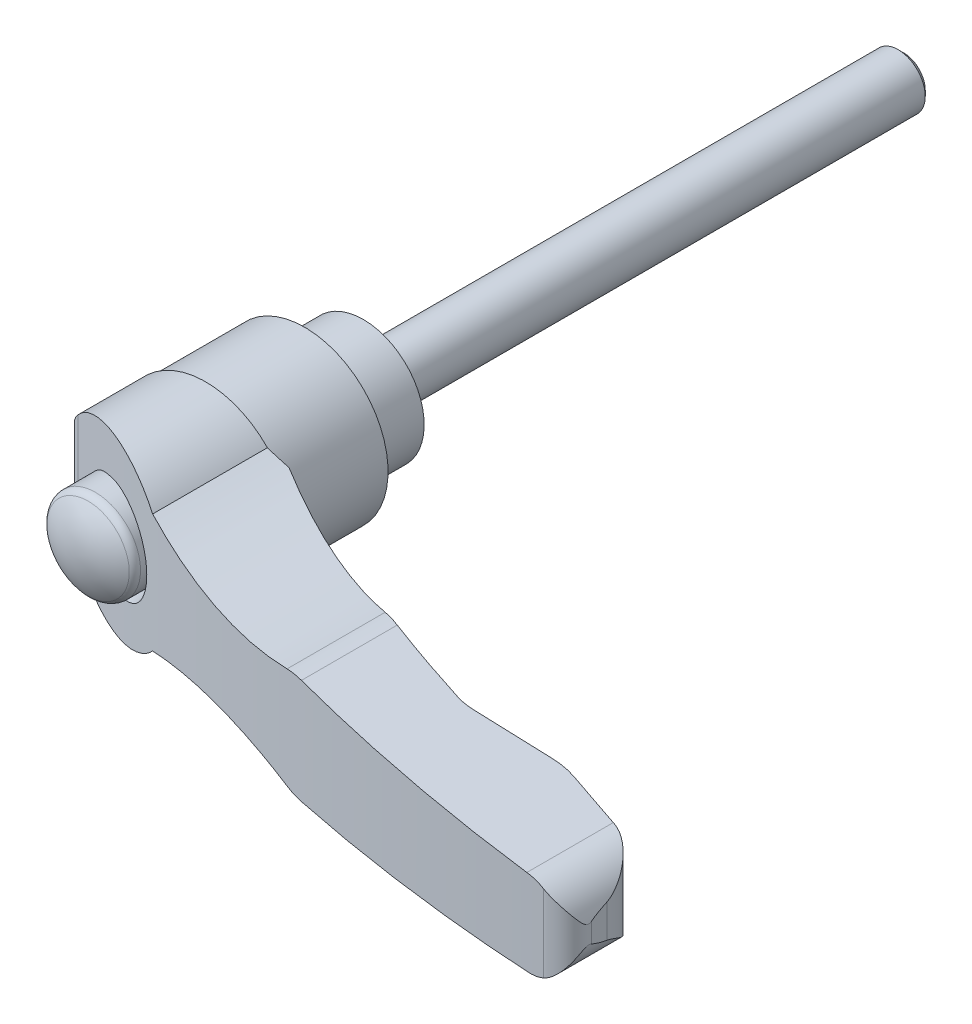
ISO-10303-21;
HEADER;
FILE_DESCRIPTION(('STEP AP214'),'2;1');
FILE_NAME('part.step','',(''),(''),'','','');
FILE_SCHEMA(('AUTOMOTIVE_DESIGN { 1 0 10303 214 1 1 1 1 }'));
ENDSEC;
DATA;
#1=APPLICATION_CONTEXT('core data for automotive mechanical design processes');
#2=APPLICATION_PROTOCOL_DEFINITION('international standard','automotive_design',2000,#1);
#3=PRODUCT_CONTEXT('',#1,'mechanical');
#4=PRODUCT('Part','Part','',(#3));
#5=PRODUCT_RELATED_PRODUCT_CATEGORY('part','',(#4));
#6=PRODUCT_DEFINITION_FORMATION('','',#4);
#7=PRODUCT_DEFINITION_CONTEXT('part definition',#1,'design');
#8=PRODUCT_DEFINITION('design','',#6,#7);
#9=PRODUCT_DEFINITION_SHAPE('','',#8);
#10=(LENGTH_UNIT() NAMED_UNIT(*) SI_UNIT(.MILLI.,.METRE.));
#11=(NAMED_UNIT(*) PLANE_ANGLE_UNIT() SI_UNIT($,.RADIAN.));
#12=(NAMED_UNIT(*) SI_UNIT($,.STERADIAN.) SOLID_ANGLE_UNIT());
#13=UNCERTAINTY_MEASURE_WITH_UNIT(LENGTH_MEASURE(1.E-05),#10,'distance_accuracy_value','');
#14=(GEOMETRIC_REPRESENTATION_CONTEXT(3) GLOBAL_UNCERTAINTY_ASSIGNED_CONTEXT((#13)) GLOBAL_UNIT_ASSIGNED_CONTEXT((#10,
#11,#12)) REPRESENTATION_CONTEXT('',''));
#15=CARTESIAN_POINT('',(0.,0.,0.));
#16=DIRECTION('',(0.,0.,1.));
#17=DIRECTION('',(1.,0.,0.));
#18=AXIS2_PLACEMENT_3D('',#15,#16,#17);
#19=CARTESIAN_POINT('',(0.,0.,-7.19325));
#20=DIRECTION('',(0.,0.,-1.));
#21=DIRECTION('',(0.,1.,0.));
#22=AXIS2_PLACEMENT_3D('',#19,#20,#21);
#23=CYLINDRICAL_SURFACE('',#22,3.);
#24=CARTESIAN_POINT('',(0.,0.,0.));
#25=DIRECTION('',(0.,0.,-1.));
#26=DIRECTION('',(0.,1.,0.));
#27=AXIS2_PLACEMENT_3D('',#24,#25,#26);
#28=CIRCLE('',#27,3.);
#29=CARTESIAN_POINT('',(0.,3.,0.));
#30=VERTEX_POINT('',#29);
#31=EDGE_CURVE('E17',#30,#30,#28,.F.);
#32=ORIENTED_EDGE('',*,*,#31,.F.);
#33=EDGE_LOOP('',(#32));
#34=FACE_BOUND('',#33,.T.);
#35=CARTESIAN_POINT('',(0.,0.,-59.3865000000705));
#36=DIRECTION('',(0.,0.,1.));
#37=DIRECTION('',(1.,0.,0.));
#38=AXIS2_PLACEMENT_3D('',#35,#36,#37);
#39=CIRCLE('',#38,3.);
#40=CARTESIAN_POINT('',(3.,0.,-59.3865000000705));
#41=VERTEX_POINT('',#40);
#42=EDGE_CURVE('E441',#41,#41,#39,.T.);
#43=ORIENTED_EDGE('',*,*,#42,.T.);
#44=EDGE_LOOP('',(#43));
#45=FACE_BOUND('',#44,.T.);
#46=ADVANCED_FACE('F14',(#34,#45),#23,.T.);
#47=CARTESIAN_POINT('',(4.875,0.,0.));
#48=DIRECTION('',(0.,0.,-1.));
#49=DIRECTION('',(0.,1.,0.));
#50=AXIS2_PLACEMENT_3D('',#47,#48,#49);
#51=PLANE('',#50);
#52=ORIENTED_EDGE('',*,*,#31,.T.);
#53=EDGE_LOOP('',(#52));
#54=FACE_BOUND('',#53,.T.);
#55=CARTESIAN_POINT('',(0.,0.,0.));
#56=DIRECTION('',(0.,0.,-1.));
#57=DIRECTION('',(0.,1.,0.));
#58=AXIS2_PLACEMENT_3D('',#55,#56,#57);
#59=CIRCLE('',#58,6.75);
#60=CARTESIAN_POINT('',(0.,6.75,0.));
#61=VERTEX_POINT('',#60);
#62=EDGE_CURVE('E194',#61,#61,#59,.F.);
#63=ORIENTED_EDGE('',*,*,#62,.F.);
#64=EDGE_LOOP('',(#63));
#65=FACE_BOUND('',#64,.T.);
#66=ADVANCED_FACE('F839',(#54,#65),#51,.T.);
#67=CARTESIAN_POINT('',(0.,0.,8.25));
#68=DIRECTION('',(0.,0.,-1.));
#69=DIRECTION('',(0.,1.,0.));
#70=AXIS2_PLACEMENT_3D('',#67,#68,#69);
#71=CYLINDRICAL_SURFACE('',#70,6.75);
#72=ORIENTED_EDGE('',*,*,#62,.T.);
#73=EDGE_LOOP('',(#72));
#74=FACE_BOUND('',#73,.T.);
#75=CARTESIAN_POINT('',(0.,0.,7.15000000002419));
#76=DIRECTION('',(0.,0.,-1.));
#77=DIRECTION('',(1.,0.,0.));
#78=AXIS2_PLACEMENT_3D('',#75,#76,#77);
#79=CIRCLE('',#78,6.74999999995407);
#80=CARTESIAN_POINT('',(6.74999999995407,0.,7.15000000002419));
#81=VERTEX_POINT('',#80);
#82=EDGE_CURVE('E192',#81,#81,#79,.T.);
#83=ORIENTED_EDGE('',*,*,#82,.T.);
#84=EDGE_LOOP('',(#83));
#85=FACE_BOUND('',#84,.T.);
#86=ADVANCED_FACE('F829',(#74,#85),#71,.T.);
#87=CARTESIAN_POINT('',(0.,0.,6.9000000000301));
#88=DIRECTION('',(0.,0.,-1.));
#89=DIRECTION('',(0.,1.,0.));
#90=AXIS2_PLACEMENT_3D('',#87,#88,#89);
#91=CONICAL_SURFACE('',#90,7.000000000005,0.785398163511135);
#92=ORIENTED_EDGE('',*,*,#82,.F.);
#93=EDGE_LOOP('',(#92));
#94=FACE_BOUND('',#93,.T.);
#95=CARTESIAN_POINT('',(0.,0.,6.9));
#96=DIRECTION('',(0.,0.,-1.));
#97=DIRECTION('',(0.,1.,0.));
#98=AXIS2_PLACEMENT_3D('',#95,#96,#97);
#99=CIRCLE('',#98,7.);
#100=CARTESIAN_POINT('',(0.,7.,6.9));
#101=VERTEX_POINT('',#100);
#102=EDGE_CURVE('E184',#101,#101,#99,.T.);
#103=ORIENTED_EDGE('',*,*,#102,.T.);
#104=EDGE_LOOP('',(#103));
#105=FACE_BOUND('',#104,.T.);
#106=ADVANCED_FACE('F819',(#94,#105),#91,.F.);
#107=CARTESIAN_POINT('',(0.,0.,6.2));
#108=DIRECTION('',(0.,0.,-1.));
#109=DIRECTION('',(0.,1.,0.));
#110=AXIS2_PLACEMENT_3D('',#107,#108,#109);
#111=CYLINDRICAL_SURFACE('',#110,7.);
#112=ORIENTED_EDGE('',*,*,#102,.F.);
#113=EDGE_LOOP('',(#112));
#114=FACE_BOUND('',#113,.T.);
#115=CARTESIAN_POINT('',(0.,0.,6.5));
#116=DIRECTION('',(0.,0.,-1.));
#117=DIRECTION('',(0.,1.,0.));
#118=AXIS2_PLACEMENT_3D('',#115,#116,#117);
#119=CIRCLE('',#118,7.);
#120=CARTESIAN_POINT('',(0.,7.,6.5));
#121=VERTEX_POINT('',#120);
#122=EDGE_CURVE('E181',#121,#121,#119,.F.);
#123=ORIENTED_EDGE('',*,*,#122,.F.);
#124=EDGE_LOOP('',(#123));
#125=FACE_BOUND('',#124,.T.);
#126=ADVANCED_FACE('F811',(#114,#125),#111,.F.);
#127=CARTESIAN_POINT('',(-9.01003775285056,-19.,6.5));
#128=DIRECTION('',(0.707106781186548,0.,0.707106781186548));
#129=DIRECTION('',(-0.707106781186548,0.,0.707106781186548));
#130=AXIS2_PLACEMENT_3D('',#127,#128,#129);
#131=PLANE('',#130);
#132=DIRECTION('',(0.,1.,0.));
#133=VECTOR('',#132,1.);
#134=CARTESIAN_POINT('',(-9.01003775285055,0.,6.5));
#135=LINE('',#134,#133);
#136=CARTESIAN_POINT('',(-9.01003775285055,-2.13584185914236,6.5));
#137=VERTEX_POINT('',#136);
#138=CARTESIAN_POINT('',(-9.01003775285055,2.13584185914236,6.5));
#139=VERTEX_POINT('',#138);
#140=EDGE_CURVE('E165',#137,#139,#135,.T.);
#141=ORIENTED_EDGE('',*,*,#140,.F.);
#142=CARTESIAN_POINT('',(-0.00999999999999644,0.,-2.50003775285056));
#143=DIRECTION('',(0.707106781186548,0.,0.707106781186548));
#144=DIRECTION('',(-0.707106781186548,0.,0.707106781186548));
#145=AXIS2_PLACEMENT_3D('',#142,#143,#144);
#146=ELLIPSE('',#145,13.0814754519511,9.25);
#147=EDGE_CURVE('E168',#139,#137,#146,.T.);
#148=ORIENTED_EDGE('',*,*,#147,.F.);
#149=EDGE_LOOP('',(#141,#148));
#150=FACE_BOUND('',#149,.T.);
#151=ADVANCED_FACE('F170',(#150),#131,.F.);
#152=CARTESIAN_POINT('',(-4.635,0.,6.5));
#153=DIRECTION('',(0.,0.,-1.));
#154=DIRECTION('',(0.,1.,0.));
#155=AXIS2_PLACEMENT_3D('',#152,#153,#154);
#156=PLANE('',#155);
#157=ORIENTED_EDGE('',*,*,#140,.T.);
#158=CARTESIAN_POINT('',(-0.00999999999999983,0.,6.5));
#159=DIRECTION('',(0.,0.,1.));
#160=DIRECTION('',(-1.,0.,0.));
#161=AXIS2_PLACEMENT_3D('',#158,#159,#160);
#162=CIRCLE('',#161,9.25);
#163=EDGE_CURVE('E172',#137,#139,#162,.T.);
#164=ORIENTED_EDGE('',*,*,#163,.F.);
#165=EDGE_LOOP('',(#157,#164));
#166=FACE_BOUND('',#165,.T.);
#167=ORIENTED_EDGE('',*,*,#122,.T.);
#168=EDGE_LOOP('',(#167));
#169=FACE_BOUND('',#168,.T.);
#170=ADVANCED_FACE('F179',(#166,#169),#156,.T.);
#171=CARTESIAN_POINT('',(-0.0100000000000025,0.,13.5625));
#172=DIRECTION('',(0.,0.,1.));
#173=DIRECTION('',(-1.,0.,0.));
#174=AXIS2_PLACEMENT_3D('',#171,#172,#173);
#175=CYLINDRICAL_SURFACE('',#174,9.25);
#176=ORIENTED_EDGE('',*,*,#163,.T.);
#177=ORIENTED_EDGE('',*,*,#147,.T.);
#178=EDGE_LOOP('',(#176,#177));
#179=FACE_BOUND('',#178,.T.);
#180=CARTESIAN_POINT('',(-0.010000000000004,0.,17.5));
#181=DIRECTION('',(0.,0.,1.));
#182=DIRECTION('',(-1.,0.,0.));
#183=AXIS2_PLACEMENT_3D('',#180,#181,#182);
#184=CIRCLE('',#183,9.25);
#185=CARTESIAN_POINT('',(-9.26,0.,17.5));
#186=VERTEX_POINT('',#185);
#187=CARTESIAN_POINT('',(9.23999999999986,0.,17.5000000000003));
#188=VERTEX_POINT('',#187);
#189=EDGE_CURVE('E419',#186,#188,#184,.T.);
#190=ORIENTED_EDGE('',*,*,#189,.F.);
#191=CARTESIAN_POINT('',(-0.010000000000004,0.,17.5));
#192=DIRECTION('',(0.,0.,1.));
#193=DIRECTION('',(-1.,0.,0.));
#194=AXIS2_PLACEMENT_3D('',#191,#192,#193);
#195=CIRCLE('',#194,9.25);
#196=EDGE_CURVE('E428',#188,#186,#195,.T.);
#197=ORIENTED_EDGE('',*,*,#196,.F.);
#198=EDGE_LOOP('',(#190,#197));
#199=FACE_BOUND('',#198,.T.);
#200=ADVANCED_FACE('F174',(#179,#199),#175,.T.);
#201=CARTESIAN_POINT('',(0.,0.,24.));
#202=DIRECTION('',(1.,0.,0.));
#203=DIRECTION('',(0.,0.,1.));
#204=AXIS2_PLACEMENT_3D('',#201,#202,#203);
#205=SPHERICAL_SURFACE('',#204,8.);
#206=CARTESIAN_POINT('',(0.,0.,30.5652144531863));
#207=DIRECTION('',(0.,0.,1.));
#208=DIRECTION('',(0.,-1.,0.));
#209=AXIS2_PLACEMENT_3D('',#206,#207,#208);
#210=CIRCLE('',#209,4.57142857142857);
#211=CARTESIAN_POINT('',(0.,-4.57142857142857,30.5652144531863));
#212=VERTEX_POINT('',#211);
#213=EDGE_CURVE('E403',#212,#212,#210,.F.);
#214=ORIENTED_EDGE('',*,*,#213,.F.);
#215=EDGE_LOOP('',(#214));
#216=FACE_BOUND('',#215,.T.);
#217=ADVANCED_FACE('F778',(#216),#205,.T.);
#218=CARTESIAN_POINT('',(64.6274051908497,-10.5,37.5817950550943));
#219=DIRECTION('',(0.992331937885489,0.,-0.123601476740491));
#220=DIRECTION('',(0.123601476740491,0.,0.992331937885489));
#221=AXIS2_PLACEMENT_3D('',#218,#219,#220);
#222=PLANE('',#221);
#223=CARTESIAN_POINT('',(60.25,0.,2.43788666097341));
#224=DIRECTION('',(0.992331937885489,0.,-0.123601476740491));
#225=DIRECTION('',(0.123601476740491,0.,0.992331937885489));
#226=AXIS2_PLACEMENT_3D('',#223,#224,#225);
#227=ELLIPSE('',#226,38.4299615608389,4.75);
#228=CARTESIAN_POINT('',(64.8745408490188,1.08449155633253,39.5659186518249));
#229=VERTEX_POINT('',#228);
#230=CARTESIAN_POINT('',(64.6274051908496,1.84413226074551,37.5817950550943));
#231=VERTEX_POINT('',#230);
#232=EDGE_CURVE('E555',#229,#231,#227,.F.);
#233=ORIENTED_EDGE('',*,*,#232,.F.);
#234=DIRECTION('',(0.,-1.,0.));
#235=VECTOR('',#234,1.);
#236=CARTESIAN_POINT('',(64.8745408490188,-10.5,39.5659186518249));
#237=LINE('',#236,#235);
#238=CARTESIAN_POINT('',(64.8745408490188,-1.08449155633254,39.5659186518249));
#239=VERTEX_POINT('',#238);
#240=EDGE_CURVE('E495',#239,#229,#237,.F.);
#241=ORIENTED_EDGE('',*,*,#240,.F.);
#242=CARTESIAN_POINT('',(60.25,0.,2.43788666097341));
#243=DIRECTION('',(0.992331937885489,0.,-0.123601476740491));
#244=DIRECTION('',(0.123601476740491,0.,0.992331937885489));
#245=AXIS2_PLACEMENT_3D('',#242,#243,#244);
#246=ELLIPSE('',#245,38.4299615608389,4.75);
#247=CARTESIAN_POINT('',(64.6274051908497,-1.84413226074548,37.5817950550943));
#248=VERTEX_POINT('',#247);
#249=EDGE_CURVE('E504',#248,#239,#246,.F.);
#250=ORIENTED_EDGE('',*,*,#249,.F.);
#251=DIRECTION('',(0.,-1.,0.));
#252=VECTOR('',#251,1.);
#253=CARTESIAN_POINT('',(64.6274051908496,-10.5,37.5817950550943));
#254=LINE('',#253,#252);
#255=EDGE_CURVE('E177',#231,#248,#254,.T.);
#256=ORIENTED_EDGE('',*,*,#255,.F.);
#257=EDGE_LOOP('',(#233,#241,#250,#256));
#258=FACE_BOUND('',#257,.T.);
#259=ADVANCED_FACE('F543',(#258),#222,.T.);
#260=CARTESIAN_POINT('',(58.6337202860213,-10.5,38.3283479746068));
#261=DIRECTION('',(0.,-1.,0.));
#262=DIRECTION('',(1.,0.,0.));
#263=AXIS2_PLACEMENT_3D('',#260,#261,#262);
#264=CYLINDRICAL_SURFACE('',#263,6.04);
#265=CARTESIAN_POINT('',(64.6274051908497,1.84413226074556,37.5817950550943));
#266=CARTESIAN_POINT('',(64.6175868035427,1.86745330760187,37.5030045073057));
#267=CARTESIAN_POINT('',(64.6063375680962,1.89362327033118,37.4253204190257));
#268=CARTESIAN_POINT('',(64.5811702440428,1.95049016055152,37.2721928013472));
#269=CARTESIAN_POINT('',(64.5672561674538,1.98118026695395,37.1967460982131));
#270=CARTESIAN_POINT('',(64.5369883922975,2.04585034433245,37.0482136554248));
#271=CARTESIAN_POINT('',(64.520645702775,2.07981523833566,36.9751189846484));
#272=CARTESIAN_POINT('',(64.4855821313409,2.15032519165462,36.8307396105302));
#273=CARTESIAN_POINT('',(64.4668602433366,2.18687133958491,36.7594556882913));
#274=CARTESIAN_POINT('',(64.4072221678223,2.29938724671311,36.547961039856));
#275=CARTESIAN_POINT('',(64.3628565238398,2.37818379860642,36.410218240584));
#276=CARTESIAN_POINT('',(64.2652007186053,2.53960895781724,36.1400450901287));
#277=CARTESIAN_POINT('',(64.2118976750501,2.6222429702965,36.007622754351));
#278=CARTESIAN_POINT('',(64.077119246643,2.81672317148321,35.7040219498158));
#279=CARTESIAN_POINT('',(63.9921849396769,2.92909268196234,35.5347005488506));
#280=CARTESIAN_POINT('',(63.8063278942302,3.15216626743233,35.2039790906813));
#281=CARTESIAN_POINT('',(63.7054078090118,3.26287061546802,35.0425777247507));
#282=CARTESIAN_POINT('',(63.4870671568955,3.47959027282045,34.7278934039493));
#283=CARTESIAN_POINT('',(63.369645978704,3.58560540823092,34.5746107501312));
#284=CARTESIAN_POINT('',(63.1179209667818,3.78996521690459,34.277236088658));
#285=CARTESIAN_POINT('',(62.9836257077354,3.88831374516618,34.1331394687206));
#286=CARTESIAN_POINT('',(62.6561598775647,4.10136712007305,33.815313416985));
#287=CARTESIAN_POINT('',(62.4571888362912,4.21258905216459,33.6450495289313));
#288=CARTESIAN_POINT('',(62.1378586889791,4.36029911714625,33.4069452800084));
#289=CARTESIAN_POINT('',(62.0281124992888,4.40629516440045,33.3305585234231));
#290=CARTESIAN_POINT('',(61.8018114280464,4.49098569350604,33.1841350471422));
#291=CARTESIAN_POINT('',(61.6852609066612,4.52968478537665,33.1140943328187));
#292=CARTESIAN_POINT('',(61.4786111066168,4.58924867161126,32.9993621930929));
#293=CARTESIAN_POINT('',(61.3900115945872,4.61209493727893,32.9529824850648));
#294=CARTESIAN_POINT('',(61.2097340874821,4.65295056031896,32.8642982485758));
#295=CARTESIAN_POINT('',(61.1180570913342,4.67096147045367,32.82199241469));
#296=CARTESIAN_POINT('',(60.9313596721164,4.70183469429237,32.7415027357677));
#297=CARTESIAN_POINT('',(60.8363219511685,4.71466416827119,32.7033462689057));
#298=CARTESIAN_POINT('',(60.6438287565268,4.73463763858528,32.631712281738));
#299=CARTESIAN_POINT('',(60.5463713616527,4.74177695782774,32.5982386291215));
#300=CARTESIAN_POINT('',(60.4479724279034,4.74587261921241,32.5672639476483));
#301=B_SPLINE_CURVE_WITH_KNOTS('',3,(#265,#266,#267,#268,#269,#270,#271,#272,#273,#274,#275,
#276,#277,#278,#279,#280,#281,#282,#283,#284,#285,#286,#287,#288,#289,#290,#291,#292,#293,#294,
#295,#296,#297,#298,#299,#300),.UNSPECIFIED.,.F.,.F.,(4,2,2,2,2,2,2,2,2,2,2,2,2,2,2,2,2,4),(0.,
0.248076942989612,0.495783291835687,0.742399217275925,0.989119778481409,1.48293160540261,
1.97746142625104,2.63745339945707,3.29733594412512,3.95724294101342,4.61681594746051,
5.46693586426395,5.89075482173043,6.31430511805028,6.62183365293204,6.92926331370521,
7.23861197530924,7.54821464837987),.UNSPECIFIED.);
#302=CARTESIAN_POINT('',(60.4479724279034,4.74587261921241,32.5672639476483));
#303=VERTEX_POINT('',#302);
#304=EDGE_CURVE('E494',#231,#303,#301,.T.);
#305=ORIENTED_EDGE('',*,*,#304,.F.);
#306=ORIENTED_EDGE('',*,*,#255,.T.);
#307=CARTESIAN_POINT('',(60.4479724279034,-4.74587261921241,32.5672639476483));
#308=CARTESIAN_POINT('',(60.5755504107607,-4.74057354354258,32.6074069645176));
#309=CARTESIAN_POINT('',(60.7015088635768,-4.73014540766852,32.6517620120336));
#310=CARTESIAN_POINT('',(60.9490652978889,-4.69992242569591,32.7481786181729));
#311=CARTESIAN_POINT('',(61.0706698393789,-4.6801423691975,32.8002279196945));
#312=CARTESIAN_POINT('',(61.3074659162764,-4.63235500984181,32.9108206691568));
#313=CARTESIAN_POINT('',(61.4227141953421,-4.60444273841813,32.9692844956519));
#314=CARTESIAN_POINT('',(61.6477173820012,-4.54120548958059,33.0925213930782));
#315=CARTESIAN_POINT('',(61.7574696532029,-4.50587699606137,33.1572974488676));
#316=CARTESIAN_POINT('',(61.9940137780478,-4.42040174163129,33.307032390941));
#317=CARTESIAN_POINT('',(62.1193938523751,-4.36870213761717,33.3933358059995));
#318=CARTESIAN_POINT('',(62.3610721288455,-4.25718277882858,33.5732278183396));
#319=CARTESIAN_POINT('',(62.4773638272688,-4.19735729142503,33.6668215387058));
#320=CARTESIAN_POINT('',(62.7012840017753,-4.07066877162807,33.8608437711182));
#321=CARTESIAN_POINT('',(62.8088611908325,-4.0037687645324,33.9613071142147));
#322=CARTESIAN_POINT('',(63.0146476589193,-3.86453813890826,34.1677809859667));
#323=CARTESIAN_POINT('',(63.1128596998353,-3.79220913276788,34.2737898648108));
#324=CARTESIAN_POINT('',(63.3331746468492,-3.61700510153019,34.5290929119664));
#325=CARTESIAN_POINT('',(63.4514763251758,-3.51235864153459,34.6804594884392));
#326=CARTESIAN_POINT('',(63.6718053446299,-3.29808480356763,34.9913387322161));
#327=CARTESIAN_POINT('',(63.7738256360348,-3.18845529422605,35.1508548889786));
#328=CARTESIAN_POINT('',(63.961662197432,-2.9676568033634,35.4770445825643));
#329=CARTESIAN_POINT('',(64.0475378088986,-2.85649513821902,35.6436890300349));
#330=CARTESIAN_POINT('',(64.2038484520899,-2.63586419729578,35.9851508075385));
#331=CARTESIAN_POINT('',(64.2742871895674,-2.52639452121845,36.1599661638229));
#332=CARTESIAN_POINT('',(64.3705847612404,-2.36382517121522,36.4361542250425));
#333=CARTESIAN_POINT('',(64.4019853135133,-2.30809068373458,36.5340606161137));
#334=CARTESIAN_POINT('',(64.4601539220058,-2.20019362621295,36.7330390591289));
#335=CARTESIAN_POINT('',(64.4869269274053,-2.14802727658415,36.8341075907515));
#336=CARTESIAN_POINT('',(64.5357331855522,-2.04890785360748,37.0402846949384));
#337=CARTESIAN_POINT('',(64.5577546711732,-2.00196785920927,37.1454025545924));
#338=CARTESIAN_POINT('',(64.596614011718,-1.91618262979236,37.360168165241));
#339=CARTESIAN_POINT('',(64.6134353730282,-1.87736327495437,37.4698291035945));
#340=CARTESIAN_POINT('',(64.6274051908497,-1.84413226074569,37.5817950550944));
#341=B_SPLINE_CURVE_WITH_KNOTS('',3,(#307,#308,#309,#310,#311,#312,#313,#314,#315,#316,#317,
#318,#319,#320,#321,#322,#323,#324,#325,#326,#327,#328,#329,#330,#331,#332,#333,#334,#335,#336,
#337,#338,#339,#340),.UNSPECIFIED.,.F.,.F.,(4,2,2,2,2,2,2,2,2,2,2,2,2,2,2,2,4),(0.,
0.401264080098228,0.801895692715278,1.19802151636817,1.59433557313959,2.0758833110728,
2.55777255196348,3.04231807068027,3.52672024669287,4.18208013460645,4.83772302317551,
5.49090678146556,6.1439335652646,6.49464389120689,6.84497677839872,7.19616755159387,
7.54846105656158),.UNSPECIFIED.);
#342=CARTESIAN_POINT('',(60.4479724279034,-4.74587261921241,32.5672639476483));
#343=VERTEX_POINT('',#342);
#344=EDGE_CURVE('E507',#343,#248,#341,.T.);
#345=ORIENTED_EDGE('',*,*,#344,.F.);
#346=DIRECTION('',(0.,-1.,0.));
#347=VECTOR('',#346,1.);
#348=CARTESIAN_POINT('',(60.4479724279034,-10.5,32.5672639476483));
#349=LINE('',#348,#347);
#350=EDGE_CURVE('E417',#303,#343,#349,.T.);
#351=ORIENTED_EDGE('',*,*,#350,.F.);
#352=EDGE_LOOP('',(#305,#306,#345,#351));
#353=FACE_BOUND('',#352,.T.);
#354=ADVANCED_FACE('F537',(#353),#264,.T.);
#355=CARTESIAN_POINT('',(-9.26,-10.5,17.5));
#356=DIRECTION('',(0.,0.,-1.));
#357=DIRECTION('',(0.,1.,0.));
#358=AXIS2_PLACEMENT_3D('',#355,#356,#357);
#359=PLANE('',#358);
#360=DIRECTION('',(0.,-1.,0.));
#361=VECTOR('',#360,1.);
#362=CARTESIAN_POINT('',(-9.26,-10.5,17.5));
#363=LINE('',#362,#361);
#364=CARTESIAN_POINT('',(-9.26,2.12188595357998,17.5));
#365=VERTEX_POINT('',#364);
#366=EDGE_CURVE('E426',#365,#186,#363,.T.);
#367=ORIENTED_EDGE('',*,*,#366,.F.);
#368=CARTESIAN_POINT('',(0.,0.,17.5));
#369=DIRECTION('',(0.,0.,1.));
#370=DIRECTION('',(0.,-1.,0.));
#371=AXIS2_PLACEMENT_3D('',#368,#369,#370);
#372=CIRCLE('',#371,9.5);
#373=CARTESIAN_POINT('',(6.84374087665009,6.58887022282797,17.5));
#374=VERTEX_POINT('',#373);
#375=EDGE_CURVE('E340',#374,#365,#372,.T.);
#376=ORIENTED_EDGE('',*,*,#375,.F.);
#377=CARTESIAN_POINT('',(19.25,44.09,17.5));
#378=DIRECTION('',(0.,0.,1.));
#379=DIRECTION('',(0.,-1.,0.));
#380=AXIS2_PLACEMENT_3D('',#377,#378,#379);
#381=CIRCLE('',#380,39.5);
#382=CARTESIAN_POINT('',(9.23999999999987,5.8794006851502,17.5000000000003));
#383=VERTEX_POINT('',#382);
#384=EDGE_CURVE('E300',#374,#383,#381,.T.);
#385=ORIENTED_EDGE('',*,*,#384,.T.);
#386=DIRECTION('',(0.,-1.,0.));
#387=VECTOR('',#386,1.);
#388=CARTESIAN_POINT('',(9.23999999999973,-10.5,17.5000000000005));
#389=LINE('',#388,#387);
#390=EDGE_CURVE('E406',#383,#188,#389,.T.);
#391=ORIENTED_EDGE('',*,*,#390,.T.);
#392=ORIENTED_EDGE('',*,*,#196,.T.);
#393=EDGE_LOOP('',(#367,#376,#385,#391,#392));
#394=FACE_BOUND('',#393,.T.);
#395=ADVANCED_FACE('F542',(#394),#359,.T.);
#396=CARTESIAN_POINT('',(-9.26,-10.5,21.2038249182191));
#397=DIRECTION('',(-1.,0.,0.));
#398=DIRECTION('',(0.,-1.,0.));
#399=AXIS2_PLACEMENT_3D('',#396,#397,#398);
#400=PLANE('',#399);
#401=ORIENTED_EDGE('',*,*,#366,.T.);
#402=DIRECTION('',(0.,1.,0.));
#403=VECTOR('',#402,1.);
#404=CARTESIAN_POINT('',(-9.26,-10.5,17.5));
#405=LINE('',#404,#403);
#406=CARTESIAN_POINT('',(-9.26,-2.12188595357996,17.5));
#407=VERTEX_POINT('',#406);
#408=EDGE_CURVE('E420',#407,#186,#405,.T.);
#409=ORIENTED_EDGE('',*,*,#408,.F.);
#410=DIRECTION('',(0.,0.,1.));
#411=VECTOR('',#410,1.);
#412=CARTESIAN_POINT('',(-9.26,-2.12188595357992,42.5));
#413=LINE('',#412,#411);
#414=CARTESIAN_POINT('',(-9.26,-2.12188595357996,21.2038249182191));
#415=VERTEX_POINT('',#414);
#416=EDGE_CURVE('E423',#415,#407,#413,.F.);
#417=ORIENTED_EDGE('',*,*,#416,.F.);
#418=DIRECTION('',(0.,-1.,0.));
#419=VECTOR('',#418,1.);
#420=CARTESIAN_POINT('',(-9.26,-10.5,21.2038249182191));
#421=LINE('',#420,#419);
#422=CARTESIAN_POINT('',(-9.26,2.12188595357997,21.2038249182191));
#423=VERTEX_POINT('',#422);
#424=EDGE_CURVE('E475',#423,#415,#421,.T.);
#425=ORIENTED_EDGE('',*,*,#424,.F.);
#426=DIRECTION('',(0.,0.,1.));
#427=VECTOR('',#426,1.);
#428=CARTESIAN_POINT('',(-9.26,2.12188595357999,42.5));
#429=LINE('',#428,#427);
#430=EDGE_CURVE('E343',#365,#423,#429,.T.);
#431=ORIENTED_EDGE('',*,*,#430,.F.);
#432=EDGE_LOOP('',(#401,#409,#417,#425,#431));
#433=FACE_BOUND('',#432,.T.);
#434=ADVANCED_FACE('F740',(#433),#400,.T.);
#435=CARTESIAN_POINT('',(-9.26,-10.5,17.5));
#436=DIRECTION('',(0.,0.,-1.));
#437=DIRECTION('',(0.,1.,0.));
#438=AXIS2_PLACEMENT_3D('',#435,#436,#437);
#439=PLANE('',#438);
#440=DIRECTION('',(0.,-1.,0.));
#441=VECTOR('',#440,1.);
#442=CARTESIAN_POINT('',(9.23999999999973,-10.5,17.5000000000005));
#443=LINE('',#442,#441);
#444=CARTESIAN_POINT('',(9.23999999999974,-5.87940068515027,17.5000000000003));
#445=VERTEX_POINT('',#444);
#446=EDGE_CURVE('E404',#188,#445,#443,.T.);
#447=ORIENTED_EDGE('',*,*,#446,.T.);
#448=CARTESIAN_POINT('',(19.25,-44.09,17.5));
#449=DIRECTION('',(0.,0.,1.));
#450=DIRECTION('',(0.,-1.,0.));
#451=AXIS2_PLACEMENT_3D('',#448,#449,#450);
#452=CIRCLE('',#451,39.5);
#453=CARTESIAN_POINT('',(6.84374087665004,-6.588870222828,17.5));
#454=VERTEX_POINT('',#453);
#455=EDGE_CURVE('E474',#445,#454,#452,.T.);
#456=ORIENTED_EDGE('',*,*,#455,.T.);
#457=CARTESIAN_POINT('',(0.,0.,17.5));
#458=DIRECTION('',(0.,0.,1.));
#459=DIRECTION('',(0.,-1.,0.));
#460=AXIS2_PLACEMENT_3D('',#457,#458,#459);
#461=CIRCLE('',#460,9.5);
#462=EDGE_CURVE('E478',#407,#454,#461,.T.);
#463=ORIENTED_EDGE('',*,*,#462,.F.);
#464=ORIENTED_EDGE('',*,*,#408,.T.);
#465=ORIENTED_EDGE('',*,*,#189,.T.);
#466=EDGE_LOOP('',(#447,#456,#463,#464,#465));
#467=FACE_BOUND('',#466,.T.);
#468=ADVANCED_FACE('F732',(#467),#439,.T.);
#469=CARTESIAN_POINT('',(53.8294507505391,-10.5,30.4829917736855));
#470=DIRECTION('',(0.300372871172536,0.,-0.95382185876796));
#471=DIRECTION('',(0.95382185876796,0.,0.300372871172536));
#472=AXIS2_PLACEMENT_3D('',#469,#470,#471);
#473=PLANE('',#472);
#474=CARTESIAN_POINT('',(60.25,0.,32.5049194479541));
#475=DIRECTION('',(0.300372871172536,0.,-0.95382185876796));
#476=DIRECTION('',(0.95382185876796,0.,0.300372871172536));
#477=AXIS2_PLACEMENT_3D('',#474,#475,#476);
#478=ELLIPSE('',#477,4.97996555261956,4.75);
#479=CARTESIAN_POINT('',(60.25,4.75,32.5049194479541));
#480=VERTEX_POINT('',#479);
#481=EDGE_CURVE('E496',#303,#480,#478,.F.);
#482=ORIENTED_EDGE('',*,*,#481,.F.);
#483=ORIENTED_EDGE('',*,*,#350,.T.);
#484=CARTESIAN_POINT('',(60.25,0.,32.5049194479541));
#485=DIRECTION('',(0.300372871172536,0.,-0.95382185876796));
#486=DIRECTION('',(0.95382185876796,0.,0.300372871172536));
#487=AXIS2_PLACEMENT_3D('',#484,#485,#486);
#488=ELLIPSE('',#487,4.97996555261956,4.75);
#489=CARTESIAN_POINT('',(60.25,-4.75,32.5049194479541));
#490=VERTEX_POINT('',#489);
#491=EDGE_CURVE('E536',#490,#343,#488,.F.);
#492=ORIENTED_EDGE('',*,*,#491,.F.);
#493=DIRECTION('',(-0.953255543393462,-0.0344545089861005,-0.300194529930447));
#494=VECTOR('',#493,1.);
#495=CARTESIAN_POINT('',(60.25,-4.75,32.5049194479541));
#496=LINE('',#495,#494);
#497=CARTESIAN_POINT('',(53.8294507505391,-4.98206460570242,30.4829917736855));
#498=VERTEX_POINT('',#497);
#499=EDGE_CURVE('E464',#490,#498,#496,.T.);
#500=ORIENTED_EDGE('',*,*,#499,.T.);
#501=DIRECTION('',(0.,-1.,0.));
#502=VECTOR('',#501,1.);
#503=CARTESIAN_POINT('',(53.8294507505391,-10.5,30.4829917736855));
#504=LINE('',#503,#502);
#505=CARTESIAN_POINT('',(53.8294507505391,4.98206460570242,30.4829917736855));
#506=VERTEX_POINT('',#505);
#507=EDGE_CURVE('E414',#506,#498,#504,.T.);
#508=ORIENTED_EDGE('',*,*,#507,.F.);
#509=DIRECTION('',(0.953255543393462,-0.0344545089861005,0.300194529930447));
#510=VECTOR('',#509,1.);
#511=CARTESIAN_POINT('',(53.8294507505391,4.98206460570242,30.4829917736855));
#512=LINE('',#511,#510);
#513=EDGE_CURVE('E299',#506,#480,#512,.T.);
#514=ORIENTED_EDGE('',*,*,#513,.T.);
#515=EDGE_LOOP('',(#482,#483,#492,#500,#508,#514));
#516=FACE_BOUND('',#515,.T.);
#517=ADVANCED_FACE('F573',(#516),#473,.T.);
#518=CARTESIAN_POINT('',(51.0780352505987,-10.5,39.22));
#519=DIRECTION('',(0.,-1.,0.));
#520=DIRECTION('',(1.,0.,0.));
#521=AXIS2_PLACEMENT_3D('',#518,#519,#520);
#522=CYLINDRICAL_SURFACE('',#521,9.15999999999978);
#523=CARTESIAN_POINT('',(51.0780352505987,5.08151188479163,39.22));
#524=DIRECTION('',(-0.0361204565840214,-0.999347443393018,0.));
#525=DIRECTION('',(0.999347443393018,-0.0361204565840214,0.));
#526=AXIS2_PLACEMENT_3D('',#523,#524,#525);
#527=ELLIPSE('',#526,9.16598132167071,9.15999999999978);
#528=CARTESIAN_POINT('',(51.0780352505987,5.08151188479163,30.06));
#529=VERTEX_POINT('',#528);
#530=EDGE_CURVE('E302',#529,#506,#527,.T.);
#531=ORIENTED_EDGE('',*,*,#530,.T.);
#532=ORIENTED_EDGE('',*,*,#507,.T.);
#533=CARTESIAN_POINT('',(51.0780352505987,-5.08151188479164,39.22));
#534=DIRECTION('',(-0.0361204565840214,0.999347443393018,0.));
#535=DIRECTION('',(-0.999347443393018,-0.0361204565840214,0.));
#536=AXIS2_PLACEMENT_3D('',#533,#534,#535);
#537=ELLIPSE('',#536,9.16598132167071,9.15999999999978);
#538=CARTESIAN_POINT('',(51.0780352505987,-5.08151188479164,30.06));
#539=VERTEX_POINT('',#538);
#540=EDGE_CURVE('E463',#498,#539,#537,.T.);
#541=ORIENTED_EDGE('',*,*,#540,.T.);
#542=DIRECTION('',(0.,1.,0.));
#543=VECTOR('',#542,1.);
#544=CARTESIAN_POINT('',(51.0780352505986,-10.5,30.06));
#545=LINE('',#544,#543);
#546=EDGE_CURVE('E411',#529,#539,#545,.F.);
#547=ORIENTED_EDGE('',*,*,#546,.F.);
#548=EDGE_LOOP('',(#531,#532,#541,#547));
#549=FACE_BOUND('',#548,.T.);
#550=ADVANCED_FACE('F716',(#549),#522,.T.);
#551=CARTESIAN_POINT('',(42.239481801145,-10.5,30.06));
#552=DIRECTION('',(0.,0.,-1.));
#553=DIRECTION('',(0.,1.,0.));
#554=AXIS2_PLACEMENT_3D('',#551,#552,#553);
#555=PLANE('',#554);
#556=DIRECTION('',(0.999347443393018,-0.0361204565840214,0.));
#557=VECTOR('',#556,1.);
#558=CARTESIAN_POINT('',(30.3472861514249,5.83080496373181,30.06));
#559=LINE('',#558,#557);
#560=CARTESIAN_POINT('',(42.239481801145,5.4009729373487,30.06));
#561=VERTEX_POINT('',#560);
#562=EDGE_CURVE('E488',#561,#529,#559,.T.);
#563=ORIENTED_EDGE('',*,*,#562,.T.);
#564=ORIENTED_EDGE('',*,*,#546,.T.);
#565=DIRECTION('',(-0.999347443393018,-0.0361204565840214,0.));
#566=VECTOR('',#565,1.);
#567=CARTESIAN_POINT('',(60.25,-4.75,30.06));
#568=LINE('',#567,#566);
#569=CARTESIAN_POINT('',(42.239481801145,-5.4009729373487,30.06));
#570=VERTEX_POINT('',#569);
#571=EDGE_CURVE('E460',#539,#570,#568,.T.);
#572=ORIENTED_EDGE('',*,*,#571,.T.);
#573=DIRECTION('',(0.,-1.,0.));
#574=VECTOR('',#573,1.);
#575=CARTESIAN_POINT('',(42.239481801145,-10.5,30.06));
#576=LINE('',#575,#574);
#577=EDGE_CURVE('E409',#570,#561,#576,.F.);
#578=ORIENTED_EDGE('',*,*,#577,.T.);
#579=EDGE_LOOP('',(#563,#564,#572,#578));
#580=FACE_BOUND('',#579,.T.);
#581=ADVANCED_FACE('F708',(#580),#555,.T.);
#582=CARTESIAN_POINT('',(42.2394818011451,-10.5,23.0799999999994));
#583=DIRECTION('',(0.,-1.,0.));
#584=DIRECTION('',(1.,0.,0.));
#585=AXIS2_PLACEMENT_3D('',#582,#583,#584);
#586=CYLINDRICAL_SURFACE('',#585,6.98000000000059);
#587=DIRECTION('',(0.,-1.,0.));
#588=VECTOR('',#587,1.);
#589=CARTESIAN_POINT('',(40.3024609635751,-10.5,29.785844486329));
#590=LINE('',#589,#588);
#591=CARTESIAN_POINT('',(40.3024609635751,-5.47098470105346,29.7858444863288));
#592=VERTEX_POINT('',#591);
#593=CARTESIAN_POINT('',(40.3024609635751,5.47098470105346,29.7858444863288));
#594=VERTEX_POINT('',#593);
#595=EDGE_CURVE('E401',#592,#594,#590,.F.);
#596=ORIENTED_EDGE('',*,*,#595,.T.);
#597=CARTESIAN_POINT('',(42.2394818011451,5.40097293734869,23.0799999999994));
#598=DIRECTION('',(-0.0361204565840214,-0.999347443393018,0.));
#599=DIRECTION('',(0.999347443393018,-0.0361204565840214,0.));
#600=AXIS2_PLACEMENT_3D('',#597,#598,#599);
#601=ELLIPSE('',#600,6.98455781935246,6.98000000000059);
#602=EDGE_CURVE('E491',#594,#561,#601,.F.);
#603=ORIENTED_EDGE('',*,*,#602,.T.);
#604=ORIENTED_EDGE('',*,*,#577,.F.);
#605=CARTESIAN_POINT('',(42.2394818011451,-5.4009729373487,23.0799999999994));
#606=DIRECTION('',(-0.0361204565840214,0.999347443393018,0.));
#607=DIRECTION('',(-0.999347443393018,-0.0361204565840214,0.));
#608=AXIS2_PLACEMENT_3D('',#605,#606,#607);
#609=ELLIPSE('',#608,6.98455781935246,6.98000000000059);
#610=EDGE_CURVE('E462',#570,#592,#609,.F.);
#611=ORIENTED_EDGE('',*,*,#610,.T.);
#612=EDGE_LOOP('',(#596,#603,#604,#611));
#613=FACE_BOUND('',#612,.T.);
#614=ADVANCED_FACE('F310',(#613),#586,.F.);
#615=CARTESIAN_POINT('',(88.9416647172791,-10.5,-138.600024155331));
#616=DIRECTION('',(0.,-1.,0.));
#617=DIRECTION('',(1.,0.,0.));
#618=AXIS2_PLACEMENT_3D('',#615,#616,#617);
#619=CYLINDRICAL_SURFACE('',#618,175.27);
#620=CARTESIAN_POINT('',(30.3472861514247,5.83080496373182,26.5855433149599));
#621=CARTESIAN_POINT('',(30.1696679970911,5.83722947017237,26.5225405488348));
#622=CARTESIAN_POINT('',(29.9919650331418,5.83772087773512,26.45918181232));
#623=CARTESIAN_POINT('',(29.6377732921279,5.82691956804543,26.3322542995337));
#624=CARTESIAN_POINT('',(29.461282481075,5.81567269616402,26.2686872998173));
#625=CARTESIAN_POINT('',(29.1095062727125,5.78152581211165,26.1413510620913));
#626=CARTESIAN_POINT('',(28.9342208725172,5.75862582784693,26.0775818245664));
#627=CARTESIAN_POINT('',(28.5848474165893,5.70116062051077,25.9498538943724));
#628=CARTESIAN_POINT('',(28.4107667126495,5.6665501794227,25.8858954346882));
#629=CARTESIAN_POINT('',(28.2379732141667,5.62616845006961,25.8220994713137));
#630=B_SPLINE_CURVE_WITH_KNOTS('',3,(#620,#621,#622,#623,#624,#625,#626,#627,#628,#629),
.UNSPECIFIED.,.F.,.F.,(4,2,2,2,4),(0.,0.565613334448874,1.1290258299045,1.69243697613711,
2.2580489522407),.UNSPECIFIED.);
#631=CARTESIAN_POINT('',(30.3472861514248,5.83080496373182,26.5855433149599));
#632=VERTEX_POINT('',#631);
#633=CARTESIAN_POINT('',(28.2379732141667,5.62616845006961,25.8220994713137));
#634=VERTEX_POINT('',#633);
#635=EDGE_CURVE('E290',#632,#634,#630,.T.);
#636=ORIENTED_EDGE('',*,*,#635,.F.);
#637=CARTESIAN_POINT('',(88.9416647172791,3.71296724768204,-138.600024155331));
#638=DIRECTION('',(-0.0361204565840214,-0.999347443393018,0.));
#639=DIRECTION('',(0.999347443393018,-0.0361204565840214,0.));
#640=AXIS2_PLACEMENT_3D('',#637,#638,#639);
#641=ELLIPSE('',#640,175.384448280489,175.27);
#642=EDGE_CURVE('E493',#632,#594,#641,.F.);
#643=ORIENTED_EDGE('',*,*,#642,.T.);
#644=ORIENTED_EDGE('',*,*,#595,.F.);
#645=CARTESIAN_POINT('',(88.9416647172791,-3.71296724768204,-138.600024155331));
#646=DIRECTION('',(-0.0361204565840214,0.999347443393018,0.));
#647=DIRECTION('',(-0.999347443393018,-0.0361204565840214,0.));
#648=AXIS2_PLACEMENT_3D('',#645,#646,#647);
#649=ELLIPSE('',#648,175.384448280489,175.27);
#650=CARTESIAN_POINT('',(30.3472861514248,-5.83080496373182,26.5855433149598));
#651=VERTEX_POINT('',#650);
#652=EDGE_CURVE('E396',#592,#651,#649,.F.);
#653=ORIENTED_EDGE('',*,*,#652,.T.);
#654=CARTESIAN_POINT('',(28.237973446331,-5.6261685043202,25.8220995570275));
#655=CARTESIAN_POINT('',(28.4107669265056,-5.66655022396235,25.8858955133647));
#656=CARTESIAN_POINT('',(28.584847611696,-5.70116065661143,25.9498539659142));
#657=CARTESIAN_POINT('',(28.9342210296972,-5.75862584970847,26.0775818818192));
#658=CARTESIAN_POINT('',(29.1095064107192,-5.78152582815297,26.1413511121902));
#659=CARTESIAN_POINT('',(29.461282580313,-5.81567270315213,26.2686873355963));
#660=CARTESIAN_POINT('',(29.6377733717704,-5.82691957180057,26.3322543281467));
#661=CARTESIAN_POINT('',(29.9919650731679,-5.83772087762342,26.4591818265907));
#662=CARTESIAN_POINT('',(30.169668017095,-5.83722946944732,26.5225405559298));
#663=CARTESIAN_POINT('',(30.3472861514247,-5.83080496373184,26.5855433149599));
#664=B_SPLINE_CURVE_WITH_KNOTS('',3,(#654,#655,#656,#657,#658,#659,#660,#661,#662,#663),
.UNSPECIFIED.,.F.,.F.,(4,2,2,2,4),(0.,0.565611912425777,1.12902299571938,1.69243542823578,
2.25804869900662),.UNSPECIFIED.);
#665=CARTESIAN_POINT('',(28.237973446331,-5.6261685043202,25.8220995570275));
#666=VERTEX_POINT('',#665);
#667=EDGE_CURVE('E327',#666,#651,#664,.T.);
#668=ORIENTED_EDGE('',*,*,#667,.F.);
#669=CARTESIAN_POINT('',(28.237973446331,-5.6261685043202,25.8220995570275));
#670=CARTESIAN_POINT('',(27.6467124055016,-5.48799745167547,25.6038196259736));
#671=CARTESIAN_POINT('',(27.0537779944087,-5.36383084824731,25.3812778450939));
#672=CARTESIAN_POINT('',(25.8659006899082,-5.14331117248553,24.9280288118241));
#673=CARTESIAN_POINT('',(25.2709579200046,-5.04695642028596,24.6973220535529));
#674=CARTESIAN_POINT('',(24.0803912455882,-4.88185687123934,24.2280988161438));
#675=CARTESIAN_POINT('',(23.4847674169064,-4.81310925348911,23.9895831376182));
#676=CARTESIAN_POINT('',(22.2940534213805,-4.70292970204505,23.5051335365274));
#677=CARTESIAN_POINT('',(21.6989632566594,-4.66149787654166,23.2591995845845));
#678=CARTESIAN_POINT('',(19.93823636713,-4.57874286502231,22.520112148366));
#679=CARTESIAN_POINT('',(18.7748149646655,-4.57591682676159,22.0168726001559));
#680=CARTESIAN_POINT('',(16.4631439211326,-4.67145944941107,20.9870607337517));
#681=CARTESIAN_POINT('',(15.3148886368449,-4.76978933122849,20.4604974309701));
#682=CARTESIAN_POINT('',(13.7610005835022,-4.97097993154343,19.7276539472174));
#683=CARTESIAN_POINT('',(13.3455946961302,-5.03153416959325,19.5297267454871));
#684=CARTESIAN_POINT('',(12.518128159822,-5.16561835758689,19.1314774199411));
#685=CARTESIAN_POINT('',(12.1060667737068,-5.23914536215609,18.9311558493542));
#686=CARTESIAN_POINT('',(11.282699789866,-5.39957122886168,18.526898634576));
#687=CARTESIAN_POINT('',(10.8714191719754,-5.48655913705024,18.3229475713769));
#688=CARTESIAN_POINT('',(10.0527171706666,-5.67338492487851,17.9129677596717));
#689=CARTESIAN_POINT('',(9.64529662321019,-5.77322552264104,17.7069385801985));
#690=CARTESIAN_POINT('',(9.23999999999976,-5.87940068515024,17.5000000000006));
#691=B_SPLINE_CURVE_WITH_KNOTS('',3,(#669,#670,#671,#672,#673,#674,#675,#676,#677,#678,#679,
#680,#681,#682,#683,#684,#685,#686,#687,#688,#689,#690),.UNSPECIFIED.,.F.,.F.,(4,2,2,2,2,2,2,2,
2,2,4),(0.,1.93549726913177,3.87087760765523,5.80606013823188,7.74125033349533,11.5393004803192,
15.3358951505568,16.7281050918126,18.1199993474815,19.5215293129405,20.9233561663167),.UNSPECIFIED.);
#692=EDGE_CURVE('E318',#666,#445,#691,.T.);
#693=ORIENTED_EDGE('',*,*,#692,.T.);
#694=ORIENTED_EDGE('',*,*,#446,.F.);
#695=ORIENTED_EDGE('',*,*,#390,.F.);
#696=CARTESIAN_POINT('',(9.23999999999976,5.87940068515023,17.5000000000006));
#697=CARTESIAN_POINT('',(9.79948003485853,5.73283344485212,17.7856672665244));
#698=CARTESIAN_POINT('',(10.363016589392,5.598336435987,18.0695987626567));
#699=CARTESIAN_POINT('',(11.4974282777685,5.35391463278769,18.6334448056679));
#700=CARTESIAN_POINT('',(12.068303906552,5.24399150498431,18.9133590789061));
#701=CARTESIAN_POINT('',(13.2171050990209,5.04907387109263,19.4688580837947));
#702=CARTESIAN_POINT('',(13.795037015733,4.9641038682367,19.7444383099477));
#703=CARTESIAN_POINT('',(14.9564491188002,4.81968144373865,20.2904183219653));
#704=CARTESIAN_POINT('',(15.5399291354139,4.7602282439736,20.5608182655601));
#705=CARTESIAN_POINT('',(17.2745449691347,4.62260622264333,21.3530632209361));
#706=CARTESIAN_POINT('',(18.4324989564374,4.58133087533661,21.8669029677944));
#707=CARTESIAN_POINT('',(20.7578250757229,4.60168529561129,22.8686662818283));
#708=CARTESIAN_POINT('',(21.9251896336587,4.66323920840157,23.3566086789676));
#709=CARTESIAN_POINT('',(23.5210667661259,4.81923174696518,24.0035807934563));
#710=CARTESIAN_POINT('',(23.9492706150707,4.86815261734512,24.1752006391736));
#711=CARTESIAN_POINT('',(24.8053597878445,4.98022825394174,24.5144113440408));
#712=CARTESIAN_POINT('',(25.2332451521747,5.04338070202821,24.6820028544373));
#713=CARTESIAN_POINT('',(26.0913485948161,5.18451987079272,25.01422907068));
#714=CARTESIAN_POINT('',(26.5215612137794,5.26261039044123,25.1788336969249));
#715=CARTESIAN_POINT('',(27.3808010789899,5.43340909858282,25.5037362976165));
#716=CARTESIAN_POINT('',(27.8098280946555,5.52611995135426,25.6640334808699));
#717=CARTESIAN_POINT('',(28.2379732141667,5.6261684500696,25.8220994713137));
#718=B_SPLINE_CURVE_WITH_KNOTS('',3,(#696,#697,#698,#699,#700,#701,#702,#703,#704,#705,#706,
#707,#708,#709,#710,#711,#712,#713,#714,#715,#716,#717),.UNSPECIFIED.,.F.,.F.,(4,2,2,2,2,2,2,2,
2,2,4),(0.,1.93506781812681,3.87026682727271,5.80735983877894,7.74439377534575,11.5423680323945,
15.3375418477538,16.7290777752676,18.1203872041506,19.5217406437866,20.9233497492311),.UNSPECIFIED.);
#719=EDGE_CURVE('E333',#383,#634,#718,.T.);
#720=ORIENTED_EDGE('',*,*,#719,.T.);
#721=EDGE_LOOP('',(#636,#643,#644,#653,#668,#693,#694,#695,#720));
#722=FACE_BOUND('',#721,.T.);
#723=ADVANCED_FACE('F304',(#722),#619,.F.);
#724=CARTESIAN_POINT('',(0.,0.,29.744562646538));
#725=DIRECTION('',(0.,0.,1.));
#726=DIRECTION('',(0.,-1.,0.));
#727=AXIS2_PLACEMENT_3D('',#724,#725,#726);
#728=TOROIDAL_SURFACE('',#727,4.,1.);
#729=CARTESIAN_POINT('',(0.,0.,29.744562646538));
#730=DIRECTION('',(0.,0.,-1.));
#731=DIRECTION('',(0.,1.,0.));
#732=AXIS2_PLACEMENT_3D('',#729,#730,#731);
#733=CIRCLE('',#732,5.);
#734=CARTESIAN_POINT('',(0.,5.,29.744562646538));
#735=VERTEX_POINT('',#734);
#736=EDGE_CURVE('E390',#735,#735,#733,.T.);
#737=ORIENTED_EDGE('',*,*,#736,.F.);
#738=EDGE_LOOP('',(#737));
#739=FACE_BOUND('',#738,.T.);
#740=ORIENTED_EDGE('',*,*,#213,.T.);
#741=EDGE_LOOP('',(#740));
#742=FACE_BOUND('',#741,.T.);
#743=ADVANCED_FACE('F309',(#739,#742),#728,.T.);
#744=CARTESIAN_POINT('',(60.25,0.,42.5));
#745=DIRECTION('',(0.,0.,1.));
#746=DIRECTION('',(0.,-1.,0.));
#747=AXIS2_PLACEMENT_3D('',#744,#745,#746);
#748=CYLINDRICAL_SURFACE('',#747,4.75);
#749=ORIENTED_EDGE('',*,*,#249,.T.);
#750=CARTESIAN_POINT('',(62.2749077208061,-4.29677189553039,42.276905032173));
#751=CARTESIAN_POINT('',(62.3484429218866,-4.26213869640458,42.2829554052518));
#752=CARTESIAN_POINT('',(62.4212610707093,-4.22549552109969,42.2855470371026));
#753=CARTESIAN_POINT('',(62.564774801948,-4.14860038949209,42.2843574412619));
#754=CARTESIAN_POINT('',(62.6354735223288,-4.10835415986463,42.2805861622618));
#755=CARTESIAN_POINT('',(62.7735534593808,-4.02500028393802,42.2673020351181));
#756=CARTESIAN_POINT('',(62.8409620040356,-3.98192770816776,42.2578508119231));
#757=CARTESIAN_POINT('',(62.9729170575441,-3.89288589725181,42.2338060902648));
#758=CARTESIAN_POINT('',(63.0374621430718,-3.84691524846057,42.2192100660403));
#759=CARTESIAN_POINT('',(63.1798156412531,-3.7401232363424,42.1810015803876));
#760=CARTESIAN_POINT('',(63.2566999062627,-3.67855248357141,42.1560308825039));
#761=CARTESIAN_POINT('',(63.4051883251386,-3.55201688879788,42.099741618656));
#762=CARTESIAN_POINT('',(63.4767890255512,-3.48704987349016,42.0684189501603));
#763=CARTESIAN_POINT('',(63.684137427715,-3.2872638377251,41.9659030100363));
#764=CARTESIAN_POINT('',(63.811716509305,-3.14810402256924,41.8863686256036));
#765=CARTESIAN_POINT('',(64.0078346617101,-2.90809595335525,41.7387707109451));
#766=CARTESIAN_POINT('',(64.0822428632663,-2.80914674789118,41.675109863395));
#767=CARTESIAN_POINT('',(64.2213033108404,-2.6088480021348,41.5411877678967));
#768=CARTESIAN_POINT('',(64.2859552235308,-2.50749837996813,41.4709262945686));
#769=CARTESIAN_POINT('',(64.4056344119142,-2.30372384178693,41.3246959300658));
#770=CARTESIAN_POINT('',(64.4606832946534,-2.20130190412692,41.2487404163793));
#771=CARTESIAN_POINT('',(64.5615971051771,-1.9964042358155,41.091141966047));
#772=CARTESIAN_POINT('',(64.6074681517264,-1.89392858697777,41.0095028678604));
#773=CARTESIAN_POINT('',(64.6724899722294,-1.73436568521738,40.8759658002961));
#774=CARTESIAN_POINT('',(64.6946729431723,-1.67662827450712,40.8262975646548));
#775=CARTESIAN_POINT('',(64.7361015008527,-1.56239438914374,40.7242511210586));
#776=CARTESIAN_POINT('',(64.7553449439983,-1.50589884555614,40.6718709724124));
#777=CARTESIAN_POINT('',(64.7911041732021,-1.39440450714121,40.562612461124));
#778=CARTESIAN_POINT('',(64.807565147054,-1.33945042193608,40.5056705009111));
#779=CARTESIAN_POINT('',(64.8370703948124,-1.23458164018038,40.3864037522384));
#780=CARTESIAN_POINT('',(64.8501220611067,-1.18465618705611,40.3240910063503));
#781=CARTESIAN_POINT('',(64.8661549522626,-1.11985818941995,40.2264927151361));
#782=CARTESIAN_POINT('',(64.8707942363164,-1.10049352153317,40.1945209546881));
#783=CARTESIAN_POINT('',(64.8789586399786,-1.06562552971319,40.1283652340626));
#784=CARTESIAN_POINT('',(64.8824848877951,-1.05011829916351,40.0941835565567));
#785=CARTESIAN_POINT('',(64.8876748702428,-1.02693288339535,40.0295882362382));
#786=CARTESIAN_POINT('',(64.889552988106,-1.01837321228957,39.9995179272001));
#787=CARTESIAN_POINT('',(64.8921785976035,-1.00633880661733,39.9383655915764));
#788=CARTESIAN_POINT('',(64.8929291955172,-1.00285010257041,39.9072865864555));
#789=CARTESIAN_POINT('',(64.89321534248,-1.00152501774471,39.8449093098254));
#790=CARTESIAN_POINT('',(64.8927474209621,-1.00370478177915,39.8136106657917));
#791=CARTESIAN_POINT('',(64.8906454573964,-1.01337643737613,39.7517827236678));
#792=CARTESIAN_POINT('',(64.8890063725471,-1.0208912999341,39.7212573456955));
#793=CARTESIAN_POINT('',(64.8852969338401,-1.03758048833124,39.6696465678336));
#794=CARTESIAN_POINT('',(64.8834575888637,-1.04578030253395,39.6482116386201));
#795=CARTESIAN_POINT('',(64.8793233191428,-1.06393290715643,39.6063556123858));
#796=CARTESIAN_POINT('',(64.8770324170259,-1.07387013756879,39.5859274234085));
#797=CARTESIAN_POINT('',(64.8745408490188,-1.0844915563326,39.5659186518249));
#798=B_SPLINE_CURVE_WITH_KNOTS('',3,(#750,#751,#752,#753,#754,#755,#756,#757,#758,#759,#760,
#761,#762,#763,#764,#765,#766,#767,#768,#769,#770,#771,#772,#773,#774,#775,#776,#777,#778,#779,
#780,#781,#782,#783,#784,#785,#786,#787,#788,#789,#790,#791,#792,#793,#794,#795,#796,#797),
.UNSPECIFIED.,.F.,.F.,(4,2,2,2,2,2,2,2,2,2,2,2,2,2,2,2,2,2,2,2,2,2,2,4),(0.,0.244350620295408,
0.48831954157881,0.729688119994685,0.97117536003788,1.27556052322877,1.58014290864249,
2.19203994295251,2.60923519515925,3.02644469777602,3.44270300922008,3.85868287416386,
4.09658232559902,4.33465444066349,4.5769755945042,4.8187668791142,4.93157965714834,
5.04427771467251,5.13787391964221,5.23121179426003,5.32481580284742,5.41882529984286,
5.48780546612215,5.5561968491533),.UNSPECIFIED.);
#799=CARTESIAN_POINT('',(62.2749077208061,-4.2967718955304,42.2769050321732));
#800=VERTEX_POINT('',#799);
#801=EDGE_CURVE('E497',#800,#239,#798,.T.);
#802=ORIENTED_EDGE('',*,*,#801,.F.);
#803=CARTESIAN_POINT('',(60.25,-4.75,42.1009088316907));
#804=CARTESIAN_POINT('',(60.3850127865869,-4.75001526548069,42.1132857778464));
#805=CARTESIAN_POINT('',(60.5200387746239,-4.74424440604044,42.1255330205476));
#806=CARTESIAN_POINT('',(60.7892105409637,-4.72122523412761,42.149694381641));
#807=CARTESIAN_POINT('',(60.9233558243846,-4.70397094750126,42.1616083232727));
#808=CARTESIAN_POINT('',(61.1873029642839,-4.65849581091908,42.1848041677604));
#809=CARTESIAN_POINT('',(61.3171394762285,-4.63047940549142,42.1960936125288));
#810=CARTESIAN_POINT('',(61.5739811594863,-4.56367863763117,42.2181964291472));
#811=CARTESIAN_POINT('',(61.7009880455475,-4.52490099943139,42.2290100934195));
#812=CARTESIAN_POINT('',(61.9022195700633,-4.45411922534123,42.245968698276));
#813=CARTESIAN_POINT('',(61.977610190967,-4.42542278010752,42.2522814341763));
#814=CARTESIAN_POINT('',(62.1272657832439,-4.36405214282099,42.2647350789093));
#815=CARTESIAN_POINT('',(62.201522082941,-4.33135656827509,42.2708748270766));
#816=CARTESIAN_POINT('',(62.2749077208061,-4.29677189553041,42.2769050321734));
#817=B_SPLINE_CURVE_WITH_KNOTS('',3,(#803,#804,#805,#806,#807,#808,#809,#810,#811,#812,#813,
#814,#815,#816),.UNSPECIFIED.,.F.,.F.,(4,2,2,2,2,2,4),(0.,0.406617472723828,0.813446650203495,
1.21290179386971,1.6121078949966,1.8547546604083,2.09876071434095),.UNSPECIFIED.);
#818=CARTESIAN_POINT('',(60.25,-4.75,42.1009088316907));
#819=VERTEX_POINT('',#818);
#820=EDGE_CURVE('E394',#819,#800,#817,.T.);
#821=ORIENTED_EDGE('',*,*,#820,.F.);
#822=DIRECTION('',(0.,0.,1.));
#823=VECTOR('',#822,1.);
#824=CARTESIAN_POINT('',(60.25,-4.75,42.5));
#825=LINE('',#824,#823);
#826=EDGE_CURVE('E466',#819,#490,#825,.F.);
#827=ORIENTED_EDGE('',*,*,#826,.T.);
#828=ORIENTED_EDGE('',*,*,#491,.T.);
#829=ORIENTED_EDGE('',*,*,#344,.T.);
#830=EDGE_LOOP('',(#749,#802,#821,#827,#828,#829));
#831=FACE_BOUND('',#830,.T.);
#832=ADVANCED_FACE('F518',(#831),#748,.T.);
#833=CARTESIAN_POINT('',(62.4730975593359,-10.5,39.8650342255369));
#834=DIRECTION('',(0.,-1.,0.));
#835=DIRECTION('',(1.,0.,0.));
#836=AXIS2_PLACEMENT_3D('',#833,#834,#835);
#837=CYLINDRICAL_SURFACE('',#836,2.42);
#838=CARTESIAN_POINT('',(62.2749077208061,4.29677189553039,42.276905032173));
#839=CARTESIAN_POINT('',(62.3484429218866,4.26213869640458,42.2829554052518));
#840=CARTESIAN_POINT('',(62.4212610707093,4.22549552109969,42.2855470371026));
#841=CARTESIAN_POINT('',(62.564774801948,4.14860038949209,42.2843574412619));
#842=CARTESIAN_POINT('',(62.6354735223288,4.10835415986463,42.2805861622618));
#843=CARTESIAN_POINT('',(62.7735534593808,4.02500028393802,42.2673020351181));
#844=CARTESIAN_POINT('',(62.8409620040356,3.98192770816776,42.2578508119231));
#845=CARTESIAN_POINT('',(62.9729170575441,3.89288589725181,42.2338060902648));
#846=CARTESIAN_POINT('',(63.0374621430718,3.84691524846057,42.2192100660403));
#847=CARTESIAN_POINT('',(63.1798156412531,3.7401232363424,42.1810015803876));
#848=CARTESIAN_POINT('',(63.2566999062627,3.67855248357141,42.1560308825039));
#849=CARTESIAN_POINT('',(63.4051883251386,3.55201688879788,42.099741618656));
#850=CARTESIAN_POINT('',(63.4767890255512,3.48704987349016,42.0684189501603));
#851=CARTESIAN_POINT('',(63.684137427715,3.2872638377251,41.9659030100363));
#852=CARTESIAN_POINT('',(63.811716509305,3.14810402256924,41.8863686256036));
#853=CARTESIAN_POINT('',(64.0078346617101,2.90809595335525,41.7387707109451));
#854=CARTESIAN_POINT('',(64.0822428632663,2.80914674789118,41.675109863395));
#855=CARTESIAN_POINT('',(64.2213033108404,2.6088480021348,41.5411877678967));
#856=CARTESIAN_POINT('',(64.2859552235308,2.50749837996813,41.4709262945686));
#857=CARTESIAN_POINT('',(64.4056344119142,2.30372384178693,41.3246959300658));
#858=CARTESIAN_POINT('',(64.4606832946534,2.20130190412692,41.2487404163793));
#859=CARTESIAN_POINT('',(64.5615971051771,1.9964042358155,41.091141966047));
#860=CARTESIAN_POINT('',(64.6074681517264,1.89392858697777,41.0095028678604));
#861=CARTESIAN_POINT('',(64.6724899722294,1.73436568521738,40.8759658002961));
#862=CARTESIAN_POINT('',(64.6946729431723,1.67662827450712,40.8262975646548));
#863=CARTESIAN_POINT('',(64.7361015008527,1.56239438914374,40.7242511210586));
#864=CARTESIAN_POINT('',(64.7553449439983,1.50589884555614,40.6718709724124));
#865=CARTESIAN_POINT('',(64.7911041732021,1.39440450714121,40.562612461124));
#866=CARTESIAN_POINT('',(64.807565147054,1.33945042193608,40.5056705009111));
#867=CARTESIAN_POINT('',(64.8370703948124,1.23458164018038,40.3864037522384));
#868=CARTESIAN_POINT('',(64.8501220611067,1.18465618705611,40.3240910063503));
#869=CARTESIAN_POINT('',(64.8661549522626,1.11985818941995,40.2264927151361));
#870=CARTESIAN_POINT('',(64.8707942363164,1.10049352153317,40.1945209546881));
#871=CARTESIAN_POINT('',(64.8789586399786,1.06562552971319,40.1283652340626));
#872=CARTESIAN_POINT('',(64.8824848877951,1.05011829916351,40.0941835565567));
#873=CARTESIAN_POINT('',(64.8876748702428,1.02693288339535,40.0295882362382));
#874=CARTESIAN_POINT('',(64.889552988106,1.01837321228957,39.9995179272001));
#875=CARTESIAN_POINT('',(64.8921785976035,1.00633880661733,39.9383655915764));
#876=CARTESIAN_POINT('',(64.8929291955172,1.00285010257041,39.9072865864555));
#877=CARTESIAN_POINT('',(64.89321534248,1.00152501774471,39.8449093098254));
#878=CARTESIAN_POINT('',(64.8927474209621,1.00370478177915,39.8136106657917));
#879=CARTESIAN_POINT('',(64.8906454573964,1.01337643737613,39.7517827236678));
#880=CARTESIAN_POINT('',(64.8890063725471,1.0208912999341,39.7212573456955));
#881=CARTESIAN_POINT('',(64.8852969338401,1.03758048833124,39.6696465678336));
#882=CARTESIAN_POINT('',(64.8834575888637,1.04578030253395,39.6482116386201));
#883=CARTESIAN_POINT('',(64.8793233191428,1.06393290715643,39.6063556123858));
#884=CARTESIAN_POINT('',(64.8770324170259,1.07387013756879,39.5859274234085));
#885=CARTESIAN_POINT('',(64.8745408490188,1.0844915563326,39.5659186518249));
#886=B_SPLINE_CURVE_WITH_KNOTS('',3,(#838,#839,#840,#841,#842,#843,#844,#845,#846,#847,#848,
#849,#850,#851,#852,#853,#854,#855,#856,#857,#858,#859,#860,#861,#862,#863,#864,#865,#866,#867,
#868,#869,#870,#871,#872,#873,#874,#875,#876,#877,#878,#879,#880,#881,#882,#883,#884,#885),
.UNSPECIFIED.,.F.,.F.,(4,2,2,2,2,2,2,2,2,2,2,2,2,2,2,2,2,2,2,2,2,2,2,4),(0.,0.244350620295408,
0.48831954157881,0.729688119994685,0.97117536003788,1.27556052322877,1.58014290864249,
2.19203994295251,2.60923519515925,3.02644469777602,3.44270300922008,3.85868287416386,
4.09658232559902,4.33465444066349,4.5769755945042,4.8187668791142,4.93157965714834,
5.04427771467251,5.13787391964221,5.23121179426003,5.32481580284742,5.41882529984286,
5.48780546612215,5.5561968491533),.UNSPECIFIED.);
#887=CARTESIAN_POINT('',(62.2749077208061,4.2967718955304,42.2769050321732));
#888=VERTEX_POINT('',#887);
#889=EDGE_CURVE('E502',#888,#229,#886,.T.);
#890=ORIENTED_EDGE('',*,*,#889,.F.);
#891=DIRECTION('',(0.,-1.,0.));
#892=VECTOR('',#891,1.);
#893=CARTESIAN_POINT('',(62.2749077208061,-10.5,42.2769050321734));
#894=LINE('',#893,#892);
#895=EDGE_CURVE('E455',#800,#888,#894,.F.);
#896=ORIENTED_EDGE('',*,*,#895,.F.);
#897=ORIENTED_EDGE('',*,*,#801,.T.);
#898=ORIENTED_EDGE('',*,*,#240,.T.);
#899=EDGE_LOOP('',(#890,#896,#897,#898));
#900=FACE_BOUND('',#899,.T.);
#901=ADVANCED_FACE('F516',(#900),#837,.T.);
#902=CARTESIAN_POINT('',(60.25,0.,42.5));
#903=DIRECTION('',(0.,0.,1.));
#904=DIRECTION('',(0.,-1.,0.));
#905=AXIS2_PLACEMENT_3D('',#902,#903,#904);
#906=CYLINDRICAL_SURFACE('',#905,4.75);
#907=ORIENTED_EDGE('',*,*,#232,.T.);
#908=ORIENTED_EDGE('',*,*,#304,.T.);
#909=ORIENTED_EDGE('',*,*,#481,.T.);
#910=DIRECTION('',(0.,0.,1.));
#911=VECTOR('',#910,1.);
#912=CARTESIAN_POINT('',(60.25,4.75,42.5));
#913=LINE('',#912,#911);
#914=CARTESIAN_POINT('',(60.25,4.75,42.1009088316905));
#915=VERTEX_POINT('',#914);
#916=EDGE_CURVE('E492',#480,#915,#913,.T.);
#917=ORIENTED_EDGE('',*,*,#916,.T.);
#918=CARTESIAN_POINT('',(62.2749077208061,4.29677189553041,42.2769050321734));
#919=CARTESIAN_POINT('',(62.1526074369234,4.35442457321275,42.2668563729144));
#920=CARTESIAN_POINT('',(62.027854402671,4.40681781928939,42.2564990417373));
#921=CARTESIAN_POINT('',(61.7743193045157,4.50079963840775,42.2352210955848));
#922=CARTESIAN_POINT('',(61.6455353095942,4.54238294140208,42.2243002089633));
#923=CARTESIAN_POINT('',(61.3872932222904,4.61375080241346,42.2021612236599));
#924=CARTESIAN_POINT('',(61.2578894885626,4.6437352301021,42.1909520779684));
#925=CARTESIAN_POINT('',(60.9971282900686,4.69274765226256,42.1681230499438));
#926=CARTESIAN_POINT('',(60.8657720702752,4.71178234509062,42.156503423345));
#927=CARTESIAN_POINT('',(60.6537297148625,4.73349762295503,42.1375484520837));
#928=CARTESIAN_POINT('',(60.5733751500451,4.7396643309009,42.1303200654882));
#929=CARTESIAN_POINT('',(60.412016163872,4.74792732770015,42.1157134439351));
#930=CARTESIAN_POINT('',(60.3310106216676,4.75000065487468,42.1083345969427));
#931=CARTESIAN_POINT('',(60.25,4.75,42.1009088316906));
#932=B_SPLINE_CURVE_WITH_KNOTS('',3,(#918,#919,#920,#921,#922,#923,#924,#925,#926,#927,#928,
#929,#930,#931),.UNSPECIFIED.,.F.,.F.,(4,2,2,2,2,2,4),(0.,0.406619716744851,0.813437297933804,
1.21289403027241,1.61210613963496,1.8547544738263,2.09876011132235),.UNSPECIFIED.);
#933=EDGE_CURVE('E221',#888,#915,#932,.T.);
#934=ORIENTED_EDGE('',*,*,#933,.F.);
#935=ORIENTED_EDGE('',*,*,#889,.T.);
#936=EDGE_LOOP('',(#907,#908,#909,#917,#934,#935));
#937=FACE_BOUND('',#936,.T.);
#938=ADVANCED_FACE('F556',(#937),#906,.T.);
#939=CARTESIAN_POINT('',(30.3472861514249,5.83080496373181,42.5));
#940=DIRECTION('',(-0.0361204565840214,-0.999347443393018,0.));
#941=DIRECTION('',(0.999347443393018,-0.0361204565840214,0.));
#942=AXIS2_PLACEMENT_3D('',#939,#940,#941);
#943=PLANE('',#942);
#944=ORIENTED_EDGE('',*,*,#530,.F.);
#945=ORIENTED_EDGE('',*,*,#562,.F.);
#946=ORIENTED_EDGE('',*,*,#602,.F.);
#947=ORIENTED_EDGE('',*,*,#642,.F.);
#948=DIRECTION('',(0.,0.,1.));
#949=VECTOR('',#948,1.);
#950=CARTESIAN_POINT('',(30.3472861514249,5.83080496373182,42.5));
#951=LINE('',#950,#949);
#952=CARTESIAN_POINT('',(30.3472861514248,5.83080496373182,37.2241685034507));
#953=VERTEX_POINT('',#952);
#954=EDGE_CURVE('E298',#953,#632,#951,.F.);
#955=ORIENTED_EDGE('',*,*,#954,.F.);
#956=CARTESIAN_POINT('',(79.9481999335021,4.03802742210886,-172.7981859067));
#957=DIRECTION('',(-0.0361204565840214,-0.999347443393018,0.));
#958=DIRECTION('',(0.999347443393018,-0.0361204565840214,0.));
#959=AXIS2_PLACEMENT_3D('',#956,#957,#958);
#960=ELLIPSE('',#959,215.940913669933,215.8);
#961=EDGE_CURVE('E279',#915,#953,#960,.T.);
#962=ORIENTED_EDGE('',*,*,#961,.F.);
#963=ORIENTED_EDGE('',*,*,#916,.F.);
#964=ORIENTED_EDGE('',*,*,#513,.F.);
#965=EDGE_LOOP('',(#944,#945,#946,#947,#955,#962,#963,#964));
#966=FACE_BOUND('',#965,.T.);
#967=ADVANCED_FACE('F285',(#966),#943,.F.);
#968=CARTESIAN_POINT('',(30.0583224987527,-2.16397458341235,42.5));
#969=DIRECTION('',(0.,0.,1.));
#970=DIRECTION('',(0.,-1.,0.));
#971=AXIS2_PLACEMENT_3D('',#968,#969,#970);
#972=CYLINDRICAL_SURFACE('',#971,8.);
#973=CARTESIAN_POINT('',(30.3472861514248,5.83080496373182,37.2241685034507));
#974=CARTESIAN_POINT('',(30.1697645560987,5.83722808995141,37.1822446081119));
#975=CARTESIAN_POINT('',(29.9920959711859,5.83772255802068,37.1400457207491));
#976=CARTESIAN_POINT('',(29.6379436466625,5.82692706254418,37.0554559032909));
#977=CARTESIAN_POINT('',(29.4614580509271,5.81568603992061,37.0130664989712));
#978=CARTESIAN_POINT('',(29.1096637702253,5.78154479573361,36.928102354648));
#979=CARTESIAN_POINT('',(28.9343550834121,5.75864459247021,36.8855276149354));
#980=CARTESIAN_POINT('',(28.5849091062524,5.70117409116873,36.8002038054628));
#981=CARTESIAN_POINT('',(28.4107797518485,5.66655551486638,36.7574547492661));
#982=CARTESIAN_POINT('',(28.2379732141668,5.62616845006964,36.714802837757));
#983=B_SPLINE_CURVE_WITH_KNOTS('',3,(#973,#974,#975,#976,#977,#978,#979,#980,#981,#982),
.UNSPECIFIED.,.F.,.F.,(4,2,2,2,4),(0.,0.54745399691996,1.09263401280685,1.63781317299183,
2.18526630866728),.UNSPECIFIED.);
#984=CARTESIAN_POINT('',(28.2379732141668,5.62616845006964,36.714802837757));
#985=VERTEX_POINT('',#984);
#986=EDGE_CURVE('E272',#953,#985,#983,.T.);
#987=ORIENTED_EDGE('',*,*,#986,.F.);
#988=ORIENTED_EDGE('',*,*,#954,.T.);
#989=ORIENTED_EDGE('',*,*,#635,.T.);
#990=DIRECTION('',(0.,0.,1.));
#991=VECTOR('',#990,1.);
#992=CARTESIAN_POINT('',(28.2379732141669,5.62616845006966,42.5));
#993=LINE('',#992,#991);
#994=EDGE_CURVE('E482',#634,#985,#993,.T.);
#995=ORIENTED_EDGE('',*,*,#994,.T.);
#996=EDGE_LOOP('',(#987,#988,#989,#995));
#997=FACE_BOUND('',#996,.T.);
#998=ADVANCED_FACE('F280',(#997),#972,.T.);
#999=CARTESIAN_POINT('',(19.25,44.09,42.5));
#1000=DIRECTION('',(0.,0.,1.));
#1001=DIRECTION('',(0.,-1.,0.));
#1002=AXIS2_PLACEMENT_3D('',#999,#1000,#1001);
#1003=CYLINDRICAL_SURFACE('',#1002,39.5);
#1004=ORIENTED_EDGE('',*,*,#384,.F.);
#1005=DIRECTION('',(0.,0.,1.));
#1006=VECTOR('',#1005,1.);
#1007=CARTESIAN_POINT('',(6.84374087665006,6.58887022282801,42.5));
#1008=LINE('',#1007,#1006);
#1009=CARTESIAN_POINT('',(6.84374087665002,6.58887022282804,30.2421501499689));
#1010=VERTEX_POINT('',#1009);
#1011=EDGE_CURVE('E353',#1010,#374,#1008,.F.);
#1012=ORIENTED_EDGE('',*,*,#1011,.F.);
#1013=CARTESIAN_POINT('',(28.2379732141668,5.62616845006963,36.714802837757));
#1014=CARTESIAN_POINT('',(27.6682570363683,5.49303214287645,36.5741969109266));
#1015=CARTESIAN_POINT('',(27.096301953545,5.37273903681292,36.4305600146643));
#1016=CARTESIAN_POINT('',(25.9490941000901,5.15784722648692,36.1374174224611));
#1017=CARTESIAN_POINT('',(25.3738414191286,5.0632478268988,35.9879118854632));
#1018=CARTESIAN_POINT('',(24.2212057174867,4.89974680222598,35.6832223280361));
#1019=CARTESIAN_POINT('',(23.6438227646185,4.8308443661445,35.528038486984));
#1020=CARTESIAN_POINT('',(22.4880975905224,4.71866668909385,35.2122361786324));
#1021=CARTESIAN_POINT('',(21.9097553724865,4.67539136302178,35.0516177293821));
#1022=CARTESIAN_POINT('',(20.2001196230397,4.58518828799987,34.5690900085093));
#1023=CARTESIAN_POINT('',(19.0688077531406,4.574324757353,34.2397910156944));
#1024=CARTESIAN_POINT('',(16.8150559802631,4.64900465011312,33.5637051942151));
#1025=CARTESIAN_POINT('',(15.6926136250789,4.73452041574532,33.2169234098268));
#1026=CARTESIAN_POINT('',(13.9229387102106,4.94528995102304,32.6544330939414));
#1027=CARTESIAN_POINT('',(13.270341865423,5.03968179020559,32.4435501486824));
#1028=CARTESIAN_POINT('',(11.9722268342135,5.26066415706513,32.017276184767));
#1029=CARTESIAN_POINT('',(11.3267071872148,5.38724790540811,31.8018861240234));
#1030=CARTESIAN_POINT('',(10.0356458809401,5.67400513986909,31.3643601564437));
#1031=CARTESIAN_POINT('',(9.39021472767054,5.83459695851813,31.1421728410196));
#1032=CARTESIAN_POINT('',(8.10920891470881,6.18783091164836,30.6944696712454));
#1033=CARTESIAN_POINT('',(7.47363611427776,6.38047901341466,30.4689532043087));
#1034=CARTESIAN_POINT('',(6.84374087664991,6.58887022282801,30.2421501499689));
#1035=B_SPLINE_CURVE_WITH_KNOTS('',3,(#1013,#1014,#1015,#1016,#1017,#1018,#1019,#1020,#1021,
#1022,#1023,#1024,#1025,#1026,#1027,#1028,#1029,#1030,#1031,#1032,#1033,#1034),.UNSPECIFIED.,
.F.,.F.,(4,2,2,2,2,2,2,2,2,2,4),(0.,1.80500142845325,3.60995400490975,5.41484961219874,
7.21973922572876,10.7502186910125,14.2796852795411,16.3558417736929,18.4315614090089,
20.5344750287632,22.6377805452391),.UNSPECIFIED.);
#1036=EDGE_CURVE('E265',#985,#1010,#1035,.T.);
#1037=ORIENTED_EDGE('',*,*,#1036,.F.);
#1038=ORIENTED_EDGE('',*,*,#994,.F.);
#1039=ORIENTED_EDGE('',*,*,#719,.F.);
#1040=EDGE_LOOP('',(#1004,#1012,#1037,#1038,#1039));
#1041=FACE_BOUND('',#1040,.T.);
#1042=ADVANCED_FACE('F284',(#1041),#1003,.F.);
#1043=CARTESIAN_POINT('',(0.,0.,42.5));
#1044=DIRECTION('',(0.,0.,1.));
#1045=DIRECTION('',(0.,-1.,0.));
#1046=AXIS2_PLACEMENT_3D('',#1043,#1044,#1045);
#1047=CYLINDRICAL_SURFACE('',#1046,9.5);
#1048=CARTESIAN_POINT('',(6.84374087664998,6.58887022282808,30.2421501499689));
#1049=CARTESIAN_POINT('',(6.65080045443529,6.78931825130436,30.1726847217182));
#1050=CARTESIAN_POINT('',(6.44961303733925,6.98062511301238,30.0999344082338));
#1051=CARTESIAN_POINT('',(6.03270358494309,7.34389134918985,29.9484251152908));
#1052=CARTESIAN_POINT('',(5.81698706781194,7.51585800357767,29.8696684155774));
#1053=CARTESIAN_POINT('',(5.37345447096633,7.83907665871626,29.7068832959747));
#1054=CARTESIAN_POINT('',(5.14567410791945,7.99038552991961,29.6228703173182));
#1055=CARTESIAN_POINT('',(4.67931603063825,8.27213483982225,29.4499214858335));
#1056=CARTESIAN_POINT('',(4.44073748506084,8.40257366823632,29.3609852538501));
#1057=CARTESIAN_POINT('',(3.95497881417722,8.64183737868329,29.178885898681));
#1058=CARTESIAN_POINT('',(3.70781056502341,8.75069080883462,29.0857285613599));
#1059=CARTESIAN_POINT('',(3.20629853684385,8.9466280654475,28.8956228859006));
#1060=CARTESIAN_POINT('',(2.9519521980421,9.03370401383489,28.7986731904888));
#1061=CARTESIAN_POINT('',(2.43786340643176,9.18578796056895,28.6015746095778));
#1062=CARTESIAN_POINT('',(2.17811924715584,9.25078886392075,28.5014247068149));
#1063=CARTESIAN_POINT('',(1.65503418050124,9.3585350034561,28.2985542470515));
#1064=CARTESIAN_POINT('',(1.39169304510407,9.40127882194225,28.1958335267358));
#1065=CARTESIAN_POINT('',(0.850745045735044,9.46593151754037,27.9835884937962));
#1066=CARTESIAN_POINT('',(0.573046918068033,9.48677267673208,27.8739706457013));
#1067=CARTESIAN_POINT('',(0.0174543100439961,9.50404900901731,27.6533175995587));
#1068=CARTESIAN_POINT('',(-0.260440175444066,9.50048351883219,27.5422823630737));
#1069=CARTESIAN_POINT('',(-0.814707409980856,9.46907255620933,27.3194845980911));
#1070=CARTESIAN_POINT('',(-1.09107940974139,9.44121604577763,27.2077217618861));
#1071=CARTESIAN_POINT('',(-1.64035574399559,9.36142371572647,26.9842845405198));
#1072=CARTESIAN_POINT('',(-1.91326010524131,9.30948808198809,26.8726101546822));
#1073=CARTESIAN_POINT('',(-2.46330450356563,9.17958373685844,26.6462310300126));
#1074=CARTESIAN_POINT('',(-2.74025729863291,9.10076570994,26.5315574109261));
#1075=CARTESIAN_POINT('',(-3.28644549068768,8.91808146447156,26.3041026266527));
#1076=CARTESIAN_POINT('',(-3.55568366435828,8.81422438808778,26.1913207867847));
#1077=CARTESIAN_POINT('',(-4.08433646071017,8.58204223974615,25.9686498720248));
#1078=CARTESIAN_POINT('',(-4.34375951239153,8.45373876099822,25.8587583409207));
#1079=CARTESIAN_POINT('',(-4.85090228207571,8.17329327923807,25.6428084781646));
#1080=CARTESIAN_POINT('',(-5.09862572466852,8.0211589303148,25.5367489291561));
#1081=CARTESIAN_POINT('',(-5.63245900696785,7.65837288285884,25.3070697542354));
#1082=CARTESIAN_POINT('',(-5.91533954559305,7.44217556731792,25.1845902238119));
#1083=CARTESIAN_POINT('',(-6.32150789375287,7.09368737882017,25.0077780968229));
#1084=CARTESIAN_POINT('',(-6.45385516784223,6.97351060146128,24.9499993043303));
#1085=CARTESIAN_POINT('',(-6.71211253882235,6.72529570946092,24.8369579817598));
#1086=CARTESIAN_POINT('',(-6.83802218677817,6.59725704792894,24.7816956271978));
#1087=CARTESIAN_POINT('',(-6.96050280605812,6.46540027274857,24.7278057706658));
#1088=B_SPLINE_CURVE_WITH_KNOTS('',3,(#1048,#1049,#1050,#1051,#1052,#1053,#1054,#1055,#1056,
#1057,#1058,#1059,#1060,#1061,#1062,#1063,#1064,#1065,#1066,#1067,#1068,#1069,#1070,#1071,#1072,
#1073,#1074,#1075,#1076,#1077,#1078,#1079,#1080,#1081,#1082,#1083,#1084,#1085,#1086,#1087),
.UNSPECIFIED.,.F.,.F.,(4,2,2,2,2,2,2,2,2,2,2,2,2,2,2,2,2,2,2,4),(0.,0.859932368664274,
1.71953995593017,2.57673116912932,3.43398848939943,4.29010435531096,5.14652947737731,
6.00322959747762,6.85998427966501,7.75680139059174,8.65364287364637,9.55089209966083,
10.4481343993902,11.3768514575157,12.3052299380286,13.2327921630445,14.1600570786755,
15.2871100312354,15.8504832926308,16.4138957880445),.UNSPECIFIED.);
#1089=CARTESIAN_POINT('',(-6.9605028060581,6.46540027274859,24.7278057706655));
#1090=VERTEX_POINT('',#1089);
#1091=EDGE_CURVE('E258',#1010,#1090,#1088,.T.);
#1092=ORIENTED_EDGE('',*,*,#1091,.F.);
#1093=ORIENTED_EDGE('',*,*,#1011,.T.);
#1094=ORIENTED_EDGE('',*,*,#375,.T.);
#1095=ORIENTED_EDGE('',*,*,#430,.T.);
#1096=CARTESIAN_POINT('',(-6.96050280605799,6.46540027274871,24.7278057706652));
#1097=CARTESIAN_POINT('',(-7.03231779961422,6.38808599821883,24.6962037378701));
#1098=CARTESIAN_POINT('',(-7.10244645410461,6.31000340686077,24.6627326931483));
#1099=CARTESIAN_POINT('',(-7.23932687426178,6.15248181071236,24.5923336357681));
#1100=CARTESIAN_POINT('',(-7.30607941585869,6.07304312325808,24.5554064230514));
#1101=CARTESIAN_POINT('',(-7.50117682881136,5.83307908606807,24.4399205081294));
#1102=CARTESIAN_POINT('',(-7.62451399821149,5.67074081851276,24.3565892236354));
#1103=CARTESIAN_POINT('',(-7.858971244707,5.34114768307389,24.1782057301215));
#1104=CARTESIAN_POINT('',(-7.96997106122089,5.17386167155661,24.0830545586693));
#1105=CARTESIAN_POINT('',(-8.17879590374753,4.83699870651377,23.8828542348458));
#1106=CARTESIAN_POINT('',(-8.27661999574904,4.66742159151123,23.7778043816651));
#1107=CARTESIAN_POINT('',(-8.44671903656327,4.35092903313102,23.5736273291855));
#1108=CARTESIAN_POINT('',(-8.52065594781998,4.20412950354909,23.4756965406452));
#1109=CARTESIAN_POINT('',(-8.65917083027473,3.9108906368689,23.2727600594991));
#1110=CARTESIAN_POINT('',(-8.72374447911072,3.76445149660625,23.1677511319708));
#1111=CARTESIAN_POINT('',(-8.84326982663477,3.47433360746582,22.950397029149));
#1112=CARTESIAN_POINT('',(-8.89826964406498,3.33064448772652,22.8380926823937));
#1113=CARTESIAN_POINT('',(-8.9737046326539,3.11901479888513,22.6620954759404));
#1114=CARTESIAN_POINT('',(-8.99766190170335,3.04915637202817,22.6022049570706));
#1115=CARTESIAN_POINT('',(-9.04316702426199,2.91142176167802,22.4793240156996));
#1116=CARTESIAN_POINT('',(-9.06471558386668,2.84354500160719,22.4163345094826));
#1117=CARTESIAN_POINT('',(-9.10567250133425,2.7095621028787,22.2851760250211));
#1118=CARTESIAN_POINT('',(-9.12503183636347,2.64351496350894,22.2169308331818));
#1119=CARTESIAN_POINT('',(-9.16089909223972,2.51640073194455,22.0748303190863));
#1120=CARTESIAN_POINT('',(-9.17740078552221,2.45534466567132,22.0009632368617));
#1121=CARTESIAN_POINT('',(-9.20406834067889,2.35315977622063,21.8607904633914));
#1122=CARTESIAN_POINT('',(-9.2148423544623,2.31045828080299,21.7957711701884));
#1123=CARTESIAN_POINT('',(-9.23345685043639,2.23489722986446,21.6602353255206));
#1124=CARTESIAN_POINT('',(-9.24132006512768,2.20196182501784,21.5897668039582));
#1125=CARTESIAN_POINT('',(-9.25133632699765,2.15942561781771,21.466679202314));
#1126=CARTESIAN_POINT('',(-9.25451250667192,2.14572677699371,21.4156083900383));
#1127=CARTESIAN_POINT('',(-9.25887548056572,2.12679749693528,21.3110773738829));
#1128=CARTESIAN_POINT('',(-9.26003136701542,2.12169866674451,21.2575926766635));
#1129=CARTESIAN_POINT('',(-9.26,2.12188595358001,21.2038249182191));
#1130=B_SPLINE_CURVE_WITH_KNOTS('',3,(#1096,#1097,#1098,#1099,#1100,#1101,#1102,#1103,#1104,
#1105,#1106,#1107,#1108,#1109,#1110,#1111,#1112,#1113,#1114,#1115,#1116,#1117,#1118,#1119,#1120,
#1121,#1122,#1123,#1124,#1125,#1126,#1127,#1128,#1129),.UNSPECIFIED.,.F.,.F.,(4,2,2,2,2,2,2,2,2,
2,2,2,2,2,2,2,4),(0.,0.330384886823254,0.6606934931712,1.3206088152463,1.98647783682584,
2.65239403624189,3.22603471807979,3.79993937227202,4.37087057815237,4.65604961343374,
4.94114483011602,5.23171265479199,5.52290594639,5.75797862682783,5.99117466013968,
6.14937203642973,6.3099691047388),.UNSPECIFIED.);
#1131=EDGE_CURVE('E352',#1090,#423,#1130,.T.);
#1132=ORIENTED_EDGE('',*,*,#1131,.F.);
#1133=EDGE_LOOP('',(#1092,#1093,#1094,#1095,#1132));
#1134=FACE_BOUND('',#1133,.T.);
#1135=ADVANCED_FACE('F618',(#1134),#1047,.T.);
#1136=CARTESIAN_POINT('',(-5.41,-10.5,21.2038249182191));
#1137=DIRECTION('',(0.,-1.,0.));
#1138=DIRECTION('',(1.,0.,0.));
#1139=AXIS2_PLACEMENT_3D('',#1136,#1137,#1138);
#1140=CYLINDRICAL_SURFACE('',#1139,3.85);
#1141=ORIENTED_EDGE('',*,*,#1131,.T.);
#1142=ORIENTED_EDGE('',*,*,#424,.T.);
#1143=CARTESIAN_POINT('',(-9.26,-2.12188595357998,21.2038249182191));
#1144=CARTESIAN_POINT('',(-9.26003542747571,-2.12167409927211,21.2599023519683));
#1145=CARTESIAN_POINT('',(-9.25877696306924,-2.12722877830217,21.3156412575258));
#1146=CARTESIAN_POINT('',(-9.25405235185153,-2.14771550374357,21.4242450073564));
#1147=CARTESIAN_POINT('',(-9.25062778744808,-2.16247085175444,21.4771440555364));
#1148=CARTESIAN_POINT('',(-9.23997766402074,-2.20760351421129,21.6031007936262));
#1149=CARTESIAN_POINT('',(-9.23173653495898,-2.24201817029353,21.6745707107));
#1150=CARTESIAN_POINT('',(-9.21229042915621,-2.32064222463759,21.8120663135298));
#1151=CARTESIAN_POINT('',(-9.20105702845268,-2.36494485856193,21.8780313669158));
#1152=CARTESIAN_POINT('',(-9.17027240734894,-2.48219665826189,22.0357461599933));
#1153=CARTESIAN_POINT('',(-9.14932402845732,-2.55864834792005,22.1245651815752));
#1154=CARTESIAN_POINT('',(-9.10320463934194,-2.71820654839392,22.2949289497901));
#1155=CARTESIAN_POINT('',(-9.07802368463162,-2.8013284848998,22.3764558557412));
#1156=CARTESIAN_POINT('',(-9.02370584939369,-2.97165930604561,22.534474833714));
#1157=CARTESIAN_POINT('',(-8.99455256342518,-3.05888410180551,22.6109439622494));
#1158=CARTESIAN_POINT('',(-8.93256555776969,-3.23543364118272,22.7596220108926));
#1159=CARTESIAN_POINT('',(-8.89973551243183,-3.32475621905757,22.8318350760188));
#1160=CARTESIAN_POINT('',(-8.82780149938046,-3.51150625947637,22.9781621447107));
#1161=CARTESIAN_POINT('',(-8.78841063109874,-3.60903499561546,23.052005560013));
#1162=CARTESIAN_POINT('',(-8.70541675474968,-3.80487108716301,23.1962207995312));
#1163=CARTESIAN_POINT('',(-8.66181308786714,-3.90317856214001,23.2665920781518));
#1164=CARTESIAN_POINT('',(-8.52455945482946,-4.19869595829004,23.4730544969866));
#1165=CARTESIAN_POINT('',(-8.42452811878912,-4.39633980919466,23.6043705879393));
#1166=CARTESIAN_POINT('',(-8.20766014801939,-4.78899164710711,23.8538701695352));
#1167=CARTESIAN_POINT('',(-8.09090934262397,-4.98400784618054,23.9721155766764));
#1168=CARTESIAN_POINT('',(-7.83983279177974,-5.37028861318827,24.194901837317));
#1169=CARTESIAN_POINT('',(-7.7055257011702,-5.56155691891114,24.2994570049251));
#1170=CARTESIAN_POINT('',(-7.46953320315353,-5.87192767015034,24.4585623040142));
#1171=CARTESIAN_POINT('',(-7.37307970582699,-5.99265929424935,24.5177312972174));
#1172=CARTESIAN_POINT('',(-7.17252870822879,-6.23130388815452,24.6286010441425));
#1173=CARTESIAN_POINT('',(-7.06842633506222,-6.34921499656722,24.6802969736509));
#1174=CARTESIAN_POINT('',(-6.96050280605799,-6.46540027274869,24.7278057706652));
#1175=B_SPLINE_CURVE_WITH_KNOTS('',3,(#1143,#1144,#1145,#1146,#1147,#1148,#1149,#1150,#1151,
#1152,#1153,#1154,#1155,#1156,#1157,#1158,#1159,#1160,#1161,#1162,#1163,#1164,#1165,#1166,#1167,
#1168,#1169,#1170,#1171,#1172,#1173,#1174),.UNSPECIFIED.,.F.,.F.,(4,2,2,2,2,2,2,2,2,2,2,2,2,2,2,
4),(0.,0.167404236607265,0.331688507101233,0.569582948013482,0.809823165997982,1.16607280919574,
1.52317147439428,1.88179235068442,2.24005798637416,2.62547101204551,3.01094440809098,
3.78252545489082,4.55027884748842,5.3172229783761,5.81329418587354,6.30968421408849),.UNSPECIFIED.);
#1176=CARTESIAN_POINT('',(-6.96050280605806,-6.46540027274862,24.7278057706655));
#1177=VERTEX_POINT('',#1176);
#1178=EDGE_CURVE('E344',#415,#1177,#1175,.T.);
#1179=ORIENTED_EDGE('',*,*,#1178,.T.);
#1180=DIRECTION('',(0.,-1.,0.));
#1181=VECTOR('',#1180,1.);
#1182=CARTESIAN_POINT('',(-6.96050280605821,-10.5,24.7278057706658));
#1183=LINE('',#1182,#1181);
#1184=EDGE_CURVE('E452',#1090,#1177,#1183,.T.);
#1185=ORIENTED_EDGE('',*,*,#1184,.F.);
#1186=EDGE_LOOP('',(#1141,#1142,#1179,#1185));
#1187=FACE_BOUND('',#1186,.T.);
#1188=ADVANCED_FACE('F358',(#1187),#1140,.T.);
#1189=CARTESIAN_POINT('',(0.,0.,42.5));
#1190=DIRECTION('',(0.,0.,1.));
#1191=DIRECTION('',(0.,-1.,0.));
#1192=AXIS2_PLACEMENT_3D('',#1189,#1190,#1191);
#1193=CYLINDRICAL_SURFACE('',#1192,9.5);
#1194=DIRECTION('',(0.,0.,1.));
#1195=VECTOR('',#1194,1.);
#1196=CARTESIAN_POINT('',(6.84374087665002,-6.588870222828,42.5));
#1197=LINE('',#1196,#1195);
#1198=CARTESIAN_POINT('',(6.84374087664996,-6.58887022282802,30.2421501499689));
#1199=VERTEX_POINT('',#1198);
#1200=EDGE_CURVE('E472',#454,#1199,#1197,.T.);
#1201=ORIENTED_EDGE('',*,*,#1200,.T.);
#1202=CARTESIAN_POINT('',(-6.96050280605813,-6.46540027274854,24.7278057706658));
#1203=CARTESIAN_POINT('',(-6.92192707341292,-6.50693100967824,24.7447786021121));
#1204=CARTESIAN_POINT('',(-6.88300368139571,-6.54808934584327,24.761890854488));
#1205=CARTESIAN_POINT('',(-6.64739863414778,-6.79280391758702,24.865387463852));
#1206=CARTESIAN_POINT('',(-6.44256863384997,-6.9872984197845,24.9550155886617));
#1207=CARTESIAN_POINT('',(-6.01784430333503,-7.35627538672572,25.1400189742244));
#1208=CARTESIAN_POINT('',(-5.79793933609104,-7.53074348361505,25.235398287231));
#1209=CARTESIAN_POINT('',(-5.34443226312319,-7.85910887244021,25.4311459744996));
#1210=CARTESIAN_POINT('',(-5.11079785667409,-8.01295461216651,25.5315260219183));
#1211=CARTESIAN_POINT('',(-4.63206263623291,-8.29890210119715,25.736161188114));
#1212=CARTESIAN_POINT('',(-4.38695705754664,-8.43099471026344,25.8404179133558));
#1213=CARTESIAN_POINT('',(-3.88810812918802,-8.67231775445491,26.0514721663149));
#1214=CARTESIAN_POINT('',(-3.6344009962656,-8.78163285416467,26.1582585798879));
#1215=CARTESIAN_POINT('',(-3.11910979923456,-8.97759269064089,26.3739509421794));
#1216=CARTESIAN_POINT('',(-2.85752231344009,-9.06422741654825,26.4828578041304));
#1217=CARTESIAN_POINT('',(-2.32855119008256,-9.21430211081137,26.7018343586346));
#1218=CARTESIAN_POINT('',(-2.06117300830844,-9.27776298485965,26.8119029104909));
#1219=CARTESIAN_POINT('',(-1.52211840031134,-9.38128368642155,27.0325225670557));
#1220=CARTESIAN_POINT('',(-1.25044188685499,-9.42134303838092,27.1430736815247));
#1221=CARTESIAN_POINT('',(-0.6931254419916,-9.47899232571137,27.368521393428));
#1222=CARTESIAN_POINT('',(-0.407376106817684,-9.49557427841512,27.4834067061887));
#1223=CARTESIAN_POINT('',(0.164802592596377,-9.50287718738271,27.7120242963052));
#1224=CARTESIAN_POINT('',(0.451231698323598,-9.49360676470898,27.8257569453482));
#1225=CARTESIAN_POINT('',(1.02303909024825,-9.44911019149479,28.0513934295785));
#1226=CARTESIAN_POINT('',(1.30841646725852,-9.41386528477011,28.1632958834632));
#1227=CARTESIAN_POINT('',(1.87580458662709,-9.31741166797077,28.3844022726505));
#1228=CARTESIAN_POINT('',(2.15781545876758,-9.25620396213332,28.4936063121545));
#1229=CARTESIAN_POINT('',(2.71579928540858,-9.10810597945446,28.7083536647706));
#1230=CARTESIAN_POINT('',(2.9917826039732,-9.02126425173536,28.8139034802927));
#1231=CARTESIAN_POINT('',(3.53603400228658,-8.82215499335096,29.0208063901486));
#1232=CARTESIAN_POINT('',(3.80430258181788,-8.70988911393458,29.122159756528));
#1233=CARTESIAN_POINT('',(4.33050226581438,-8.46057827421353,29.3198060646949));
#1234=CARTESIAN_POINT('',(4.58844753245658,-8.32356878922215,29.4161059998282));
#1235=CARTESIAN_POINT('',(5.0919938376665,-8.02540839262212,29.6030505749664));
#1236=CARTESIAN_POINT('',(5.33760046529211,-7.86426854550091,29.6936977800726));
#1237=CARTESIAN_POINT('',(5.80170710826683,-7.52780967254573,29.8640833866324));
#1238=CARTESIAN_POINT('',(6.0209534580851,-7.35368382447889,29.9441448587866));
#1239=CARTESIAN_POINT('',(6.44419032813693,-6.98577886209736,30.0979735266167));
#1240=CARTESIAN_POINT('',(6.64819773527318,-6.79202208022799,30.1717477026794));
#1241=CARTESIAN_POINT('',(6.84374087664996,-6.58887022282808,30.2421501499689));
#1242=B_SPLINE_CURVE_WITH_KNOTS('',3,(#1202,#1203,#1204,#1205,#1206,#1207,#1208,#1209,#1210,
#1211,#1212,#1213,#1214,#1215,#1216,#1217,#1218,#1219,#1220,#1221,#1222,#1223,#1224,#1225,#1226,
#1227,#1228,#1229,#1230,#1231,#1232,#1233,#1234,#1235,#1236,#1237,#1238,#1239,#1240,#1241),
.UNSPECIFIED.,.F.,.F.,(4,2,2,2,2,2,2,2,2,2,2,2,2,2,2,2,2,2,2,4),(0.,0.177519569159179,
1.06524500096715,1.95360339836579,2.84414268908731,3.73505521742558,4.62259467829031,
5.51052523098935,6.39765276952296,7.28479833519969,8.20898424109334,9.13286199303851,
10.05740753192,10.9819173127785,11.9046872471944,12.8273972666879,13.7487947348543,
14.6697710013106,15.5422590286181,16.4137654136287),.UNSPECIFIED.);
#1243=EDGE_CURVE('E250',#1177,#1199,#1242,.T.);
#1244=ORIENTED_EDGE('',*,*,#1243,.F.);
#1245=ORIENTED_EDGE('',*,*,#1178,.F.);
#1246=ORIENTED_EDGE('',*,*,#416,.T.);
#1247=ORIENTED_EDGE('',*,*,#462,.T.);
#1248=EDGE_LOOP('',(#1201,#1244,#1245,#1246,#1247));
#1249=FACE_BOUND('',#1248,.T.);
#1250=ADVANCED_FACE('F360',(#1249),#1193,.T.);
#1251=CARTESIAN_POINT('',(19.25,-44.09,42.5));
#1252=DIRECTION('',(0.,0.,1.));
#1253=DIRECTION('',(0.,-1.,0.));
#1254=AXIS2_PLACEMENT_3D('',#1251,#1252,#1253);
#1255=CYLINDRICAL_SURFACE('',#1254,39.5);
#1256=ORIENTED_EDGE('',*,*,#1200,.F.);
#1257=ORIENTED_EDGE('',*,*,#455,.F.);
#1258=ORIENTED_EDGE('',*,*,#692,.F.);
#1259=DIRECTION('',(0.,0.,1.));
#1260=VECTOR('',#1259,1.);
#1261=CARTESIAN_POINT('',(28.2379734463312,-5.62616850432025,42.5));
#1262=LINE('',#1261,#1260);
#1263=CARTESIAN_POINT('',(28.2379734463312,-5.62616850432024,36.7148028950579));
#1264=VERTEX_POINT('',#1263);
#1265=EDGE_CURVE('E469',#1264,#666,#1262,.F.);
#1266=ORIENTED_EDGE('',*,*,#1265,.F.);
#1267=CARTESIAN_POINT('',(6.8437408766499,-6.58887022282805,30.2421501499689));
#1268=CARTESIAN_POINT('',(7.3844195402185,-6.41000539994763,30.4368233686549));
#1269=CARTESIAN_POINT('',(7.92920773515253,-6.2427468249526,30.6305308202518));
#1270=CARTESIAN_POINT('',(9.0262984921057,-5.93176134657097,31.0156061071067));
#1271=CARTESIAN_POINT('',(9.57860132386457,-5.78803529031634,31.2069738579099));
#1272=CARTESIAN_POINT('',(11.2459907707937,-5.39257569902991,31.7770455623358));
#1273=CARTESIAN_POINT('',(12.3712412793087,-5.17666573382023,32.151603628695));
#1274=CARTESIAN_POINT('',(14.6155888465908,-4.84677638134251,32.8778967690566));
#1275=CARTESIAN_POINT('',(15.7342694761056,-4.7306437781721,33.2299536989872));
#1276=CARTESIAN_POINT('',(17.9822789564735,-4.59430824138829,33.9171845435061));
#1277=CARTESIAN_POINT('',(19.111602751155,-4.57406185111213,34.2523660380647));
#1278=CARTESIAN_POINT('',(20.9066965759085,-4.61915626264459,34.7692006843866));
#1279=CARTESIAN_POINT('',(21.5716110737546,-4.65265065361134,34.9571747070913));
#1280=CARTESIAN_POINT('',(22.9007550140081,-4.75342699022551,35.3260663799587));
#1281=CARTESIAN_POINT('',(23.5649845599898,-4.82070271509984,35.5069853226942));
#1282=CARTESIAN_POINT('',(24.8999085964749,-4.99029204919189,35.8637631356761));
#1283=CARTESIAN_POINT('',(25.5705719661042,-5.09305859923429,36.0395230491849));
#1284=CARTESIAN_POINT('',(26.9078270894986,-5.33345684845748,36.3831634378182));
#1285=CARTESIAN_POINT('',(27.5744178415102,-5.4710967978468,36.5510420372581));
#1286=CARTESIAN_POINT('',(28.2379734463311,-5.62616850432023,36.7148028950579));
#1287=B_SPLINE_CURVE_WITH_KNOTS('',3,(#1267,#1268,#1269,#1270,#1271,#1272,#1273,#1274,#1275,
#1276,#1277,#1278,#1279,#1280,#1281,#1282,#1283,#1284,#1285,#1286),.UNSPECIFIED.,.F.,.F.,(4,2,2,
2,2,2,2,2,2,4),(0.,1.8052816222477,3.61062821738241,7.22237721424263,10.7540718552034,
14.2841657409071,16.3587751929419,18.4330027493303,20.534745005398,22.6369849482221),.UNSPECIFIED.);
#1288=EDGE_CURVE('E242',#1199,#1264,#1287,.T.);
#1289=ORIENTED_EDGE('',*,*,#1288,.F.);
#1290=EDGE_LOOP('',(#1256,#1257,#1258,#1266,#1289));
#1291=FACE_BOUND('',#1290,.T.);
#1292=ADVANCED_FACE('F363',(#1291),#1255,.F.);
#1293=CARTESIAN_POINT('',(30.0583224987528,2.16397458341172,42.5));
#1294=DIRECTION('',(0.,0.,1.));
#1295=DIRECTION('',(0.,-1.,0.));
#1296=AXIS2_PLACEMENT_3D('',#1293,#1294,#1295);
#1297=CYLINDRICAL_SURFACE('',#1296,7.9999999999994);
#1298=ORIENTED_EDGE('',*,*,#667,.T.);
#1299=DIRECTION('',(0.,0.,1.));
#1300=VECTOR('',#1299,1.);
#1301=CARTESIAN_POINT('',(30.3472861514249,-5.83080496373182,42.5));
#1302=LINE('',#1301,#1300);
#1303=CARTESIAN_POINT('',(30.3472861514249,-5.83080496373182,37.2241685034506));
#1304=VERTEX_POINT('',#1303);
#1305=EDGE_CURVE('E392',#651,#1304,#1302,.T.);
#1306=ORIENTED_EDGE('',*,*,#1305,.T.);
#1307=CARTESIAN_POINT('',(28.2379734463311,-5.62616850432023,36.7148028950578));
#1308=CARTESIAN_POINT('',(28.4107799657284,-5.6665555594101,36.7574548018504));
#1309=CARTESIAN_POINT('',(28.5849093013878,-5.70117412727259,36.8002038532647));
#1310=CARTESIAN_POINT('',(28.9343552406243,-5.75864461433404,36.885527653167));
#1311=CARTESIAN_POINT('',(29.1096639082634,-5.78154481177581,36.9281023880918));
#1312=CARTESIAN_POINT('',(29.4614581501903,-5.81568604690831,37.0130665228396));
#1313=CARTESIAN_POINT('',(29.6379437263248,-5.82692706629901,37.0554559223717));
#1314=CARTESIAN_POINT('',(29.9920960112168,-5.83772255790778,37.1400457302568));
#1315=CARTESIAN_POINT('',(30.1697645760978,-5.83722808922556,37.1822446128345));
#1316=CARTESIAN_POINT('',(30.3472861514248,-5.83080496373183,37.2241685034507));
#1317=B_SPLINE_CURVE_WITH_KNOTS('',3,(#1307,#1308,#1309,#1310,#1311,#1312,#1313,#1314,#1315,
#1316),.UNSPECIFIED.,.F.,.F.,(4,2,2,2,4),(0.,0.547453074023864,1.09263217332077,1.6378121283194,
2.18526606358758),.UNSPECIFIED.);
#1318=EDGE_CURVE('E234',#1264,#1304,#1317,.T.);
#1319=ORIENTED_EDGE('',*,*,#1318,.F.);
#1320=ORIENTED_EDGE('',*,*,#1265,.T.);
#1321=EDGE_LOOP('',(#1298,#1306,#1319,#1320));
#1322=FACE_BOUND('',#1321,.T.);
#1323=ADVANCED_FACE('F368',(#1322),#1297,.T.);
#1324=CARTESIAN_POINT('',(60.25,-4.75,42.5));
#1325=DIRECTION('',(-0.0361204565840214,0.999347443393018,0.));
#1326=DIRECTION('',(-0.999347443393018,-0.0361204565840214,0.));
#1327=AXIS2_PLACEMENT_3D('',#1324,#1325,#1326);
#1328=PLANE('',#1327);
#1329=ORIENTED_EDGE('',*,*,#1305,.F.);
#1330=ORIENTED_EDGE('',*,*,#652,.F.);
#1331=ORIENTED_EDGE('',*,*,#610,.F.);
#1332=ORIENTED_EDGE('',*,*,#571,.F.);
#1333=ORIENTED_EDGE('',*,*,#540,.F.);
#1334=ORIENTED_EDGE('',*,*,#499,.F.);
#1335=ORIENTED_EDGE('',*,*,#826,.F.);
#1336=CARTESIAN_POINT('',(79.9481999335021,-4.03802742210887,-172.7981859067));
#1337=DIRECTION('',(-0.0361204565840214,0.999347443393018,0.));
#1338=DIRECTION('',(-0.999347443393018,-0.0361204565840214,0.));
#1339=AXIS2_PLACEMENT_3D('',#1336,#1337,#1338);
#1340=ELLIPSE('',#1339,215.940913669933,215.8);
#1341=EDGE_CURVE('E882',#1304,#819,#1340,.T.);
#1342=ORIENTED_EDGE('',*,*,#1341,.F.);
#1343=EDGE_LOOP('',(#1329,#1330,#1331,#1332,#1333,#1334,#1335,#1342));
#1344=FACE_BOUND('',#1343,.T.);
#1345=ADVANCED_FACE('F374',(#1344),#1328,.F.);
#1346=CARTESIAN_POINT('',(0.,0.,25.872281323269));
#1347=DIRECTION('',(0.,0.,-1.));
#1348=DIRECTION('',(0.,1.,0.));
#1349=AXIS2_PLACEMENT_3D('',#1346,#1347,#1348);
#1350=CYLINDRICAL_SURFACE('',#1349,5.);
#1351=CARTESIAN_POINT('',(0.,0.,27.1895968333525));
#1352=DIRECTION('',(0.,0.,1.));
#1353=DIRECTION('',(1.,0.,0.));
#1354=AXIS2_PLACEMENT_3D('',#1351,#1352,#1353);
#1355=CIRCLE('',#1354,5.00000000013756);
#1356=CARTESIAN_POINT('',(-1.13525555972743,-4.86941421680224,27.1895968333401));
#1357=VERTEX_POINT('',#1356);
#1358=CARTESIAN_POINT('',(-1.13525556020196,4.86941421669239,27.1895968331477));
#1359=VERTEX_POINT('',#1358);
#1360=EDGE_CURVE('E31',#1357,#1359,#1355,.T.);
#1361=ORIENTED_EDGE('',*,*,#1360,.T.);
#1362=CARTESIAN_POINT('',(-1.13525555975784,-4.86941421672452,27.1895968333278));
#1363=CARTESIAN_POINT('',(-1.27734613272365,-4.83629586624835,27.1319889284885));
#1364=CARTESIAN_POINT('',(-1.4181272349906,-4.79690838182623,27.0747324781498));
#1365=CARTESIAN_POINT('',(-1.69613576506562,-4.70579470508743,26.9613315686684));
#1366=CARTESIAN_POINT('',(-1.83336241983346,-4.65406585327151,26.9051873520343));
#1367=CARTESIAN_POINT('',(-2.10360859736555,-4.53833641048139,26.7943043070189));
#1368=CARTESIAN_POINT('',(-2.23661652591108,-4.47430492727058,26.7395694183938));
#1369=CARTESIAN_POINT('',(-2.49705790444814,-4.3343457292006,26.632100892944));
#1370=CARTESIAN_POINT('',(-2.62449175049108,-4.25841886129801,26.5793671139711));
#1371=CARTESIAN_POINT('',(-2.87299513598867,-4.09488216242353,26.476267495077));
#1372=CARTESIAN_POINT('',(-2.99405370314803,-4.00725305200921,26.4259057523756));
#1373=CARTESIAN_POINT('',(-3.22858997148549,-3.82081859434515,26.3281000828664));
#1374=CARTESIAN_POINT('',(-3.34206496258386,-3.72200928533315,26.2806571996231));
#1375=CARTESIAN_POINT('',(-3.56022095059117,-3.51390456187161,26.1892448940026));
#1376=CARTESIAN_POINT('',(-3.66491178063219,-3.40462117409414,26.1452715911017));
#1377=CARTESIAN_POINT('',(-3.86459581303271,-3.1761474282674,26.0612292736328));
#1378=CARTESIAN_POINT('',(-3.95959001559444,-3.05695809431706,26.0211598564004));
#1379=CARTESIAN_POINT('',(-4.13404662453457,-2.81612570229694,25.9474412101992));
#1380=CARTESIAN_POINT('',(-4.21406936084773,-2.69495870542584,25.9135626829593));
#1381=CARTESIAN_POINT('',(-4.3636590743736,-2.44533067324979,25.8501391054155));
#1382=CARTESIAN_POINT('',(-4.43323092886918,-2.31687307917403,25.820592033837));
#1383=CARTESIAN_POINT('',(-4.56115366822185,-2.05360123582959,25.7661965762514));
#1384=CARTESIAN_POINT('',(-4.61951002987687,-1.91879012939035,25.7413458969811));
#1385=CARTESIAN_POINT('',(-4.72433437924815,-1.64387343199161,25.6966633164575));
#1386=CARTESIAN_POINT('',(-4.77080483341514,-1.50376894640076,25.6768303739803));
#1387=CARTESIAN_POINT('',(-4.87333730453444,-1.1414190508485,25.633040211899));
#1388=CARTESIAN_POINT('',(-4.92072289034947,-0.916195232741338,25.6127691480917));
#1389=CARTESIAN_POINT('',(-4.98404575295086,-0.460597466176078,25.5856714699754));
#1390=CARTESIAN_POINT('',(-4.99999093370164,-0.23022482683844,25.5788414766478));
#1391=CARTESIAN_POINT('',(-5.00000521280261,0.132371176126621,25.5788348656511));
#1392=CARTESIAN_POINT('',(-4.99474219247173,0.264693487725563,25.5810889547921));
#1393=CARTESIAN_POINT('',(-4.97375888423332,0.528393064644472,25.5900724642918));
#1394=CARTESIAN_POINT('',(-4.95803743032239,0.659770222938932,25.5968023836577));
#1395=CARTESIAN_POINT('',(-4.91629488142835,0.920597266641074,25.6146615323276));
#1396=CARTESIAN_POINT('',(-4.89027137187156,1.05004669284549,25.6257917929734));
#1397=CARTESIAN_POINT('',(-4.8281893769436,1.30611982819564,25.6523241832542));
#1398=CARTESIAN_POINT('',(-4.79212713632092,1.43274246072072,25.667727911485));
#1399=CARTESIAN_POINT('',(-4.71043393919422,1.68195384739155,25.7025890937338));
#1400=CARTESIAN_POINT('',(-4.66482529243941,1.80455124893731,25.722037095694));
#1401=CARTESIAN_POINT('',(-4.5644141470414,2.04527204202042,25.7648041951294));
#1402=CARTESIAN_POINT('',(-4.50960824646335,2.16339375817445,25.7881247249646));
#1403=CARTESIAN_POINT('',(-4.39134583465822,2.39434871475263,25.8383795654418));
#1404=CARTESIAN_POINT('',(-4.32789319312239,2.50718429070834,25.8653122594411));
#1405=CARTESIAN_POINT('',(-4.19284723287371,2.72702841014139,25.9225466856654));
#1406=CARTESIAN_POINT('',(-4.12125083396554,2.83403472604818,25.9528496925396));
#1407=CARTESIAN_POINT('',(-3.967948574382,3.04515496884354,26.0176262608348));
#1408=CARTESIAN_POINT('',(-3.88598179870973,3.14904693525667,26.052206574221));
#1409=CARTESIAN_POINT('',(-3.71464687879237,3.34944856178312,26.1243536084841));
#1410=CARTESIAN_POINT('',(-3.62527601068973,3.44595547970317,26.1619214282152));
#1411=CARTESIAN_POINT('',(-3.3470106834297,3.72372207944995,26.2786540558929));
#1412=CARTESIAN_POINT('',(-3.14791711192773,3.89329101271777,26.3618676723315));
#1413=CARTESIAN_POINT('',(-2.71221463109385,4.20974998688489,26.5431187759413));
#1414=CARTESIAN_POINT('',(-2.4738979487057,4.35389180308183,26.6418041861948));
#1415=CARTESIAN_POINT('',(-1.97917123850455,4.59988814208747,26.8455395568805));
#1416=CARTESIAN_POINT('',(-1.72278735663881,4.70180236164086,26.9505802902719));
#1417=CARTESIAN_POINT('',(-1.40700139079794,4.79828434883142,27.0792131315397));
#1418=CARTESIAN_POINT('',(-1.35291800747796,4.81381182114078,27.101217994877));
#1419=CARTESIAN_POINT('',(-1.24437749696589,4.84300215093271,27.1453280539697));
#1420=CARTESIAN_POINT('',(-1.18992094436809,4.85666739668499,27.1674330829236));
#1421=CARTESIAN_POINT('',(-1.13525555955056,4.86941421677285,27.1895968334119));
#1422=B_SPLINE_CURVE_WITH_KNOTS('',3,(#1362,#1363,#1364,#1365,#1366,#1367,#1368,#1369,#1370,
#1371,#1372,#1373,#1374,#1375,#1376,#1377,#1378,#1379,#1380,#1381,#1382,#1383,#1384,#1385,#1386,
#1387,#1388,#1389,#1390,#1391,#1392,#1393,#1394,#1395,#1396,#1397,#1398,#1399,#1400,#1401,#1402,
#1403,#1404,#1405,#1406,#1407,#1408,#1409,#1410,#1411,#1412,#1413,#1414,#1415,#1416,#1417,#1418,
#1419,#1420,#1421),.UNSPECIFIED.,.F.,.F.,(4,2,2,2,2,2,2,2,2,2,2,2,2,2,2,2,2,2,2,2,2,2,2,2,2,2,2,
2,2,4),(0.,0.470464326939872,0.94103012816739,1.41279335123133,1.88452299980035,
2.35703963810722,2.82972424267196,3.30187245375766,3.77397191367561,4.22070134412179,
4.66722164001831,5.1135233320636,5.55973233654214,6.25021918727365,6.94053243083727,
7.33743826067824,7.73438834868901,8.13143152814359,8.52862343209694,8.92489726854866,
9.3213180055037,9.71756191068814,10.1139561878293,10.5238247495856,10.9338447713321,
11.7536445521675,12.6365113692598,13.5181257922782,13.6993667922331,13.8803731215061),.UNSPECIFIED.);
#1423=EDGE_CURVE('E23',#1357,#1359,#1422,.T.);
#1424=ORIENTED_EDGE('',*,*,#1423,.F.);
#1425=EDGE_LOOP('',(#1361,#1424));
#1426=FACE_BOUND('',#1425,.T.);
#1427=ORIENTED_EDGE('',*,*,#736,.T.);
#1428=EDGE_LOOP('',(#1427));
#1429=FACE_BOUND('',#1428,.T.);
#1430=ADVANCED_FACE('F378',(#1426,#1429),#1350,.T.);
#1431=CARTESIAN_POINT('',(0.,0.,29.8865840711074));
#1432=DIRECTION('',(0.,0.,1.));
#1433=DIRECTION('',(0.,-1.,0.));
#1434=AXIS2_PLACEMENT_3D('',#1431,#1432,#1433);
#1435=CONICAL_SURFACE('',#1434,5.82455174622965,0.29670597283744);
#1436=ORIENTED_EDGE('',*,*,#1360,.F.);
#1437=CARTESIAN_POINT('',(-1.13525555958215,4.86941421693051,27.1895968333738));
#1438=CARTESIAN_POINT('',(-0.990951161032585,4.92142048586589,27.248104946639));
#1439=CARTESIAN_POINT('',(-0.84464948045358,4.96694641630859,27.3072387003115));
#1440=CARTESIAN_POINT('',(-0.548955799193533,5.04488276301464,27.4263711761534));
#1441=CARTESIAN_POINT('',(-0.399564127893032,5.07729456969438,27.4863698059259));
#1442=CARTESIAN_POINT('',(0.0518154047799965,5.15462036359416,27.6670540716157));
#1443=CARTESIAN_POINT('',(0.357125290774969,5.17966679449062,27.7884757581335));
#1444=CARTESIAN_POINT('',(0.976586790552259,5.17580878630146,28.0331815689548));
#1445=CARTESIAN_POINT('',(1.2907480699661,5.14538394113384,28.1564235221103));
#1446=CARTESIAN_POINT('',(1.75512432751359,5.05730522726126,28.337367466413));
#1447=CARTESIAN_POINT('',(1.90884049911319,5.02084582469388,28.3970552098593));
#1448=CARTESIAN_POINT('',(2.21289362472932,4.93388314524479,28.5147263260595));
#1449=CARTESIAN_POINT('',(2.36323191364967,4.88338552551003,28.5727103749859));
#1450=CARTESIAN_POINT('',(2.65786902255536,4.769105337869,28.6859808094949));
#1451=CARTESIAN_POINT('',(2.80221310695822,4.70546021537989,28.741288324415));
#1452=CARTESIAN_POINT('',(3.08519275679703,4.56489062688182,28.8493805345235));
#1453=CARTESIAN_POINT('',(3.22383084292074,4.4879721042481,28.9021663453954));
#1454=CARTESIAN_POINT('',(3.49429315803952,4.32118853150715,29.0048395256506));
#1455=CARTESIAN_POINT('',(3.62611533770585,4.23131961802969,29.0547260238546));
#1456=CARTESIAN_POINT('',(3.8816168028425,4.03919284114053,29.1511482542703));
#1457=CARTESIAN_POINT('',(4.00530004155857,3.93694106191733,29.1976856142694));
#1458=CARTESIAN_POINT('',(4.2370464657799,3.72638971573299,29.2846578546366));
#1459=CARTESIAN_POINT('',(4.34559017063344,3.61869846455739,29.3252854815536));
#1460=CARTESIAN_POINT('',(4.55326554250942,3.39345297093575,29.4028431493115));
#1461=CARTESIAN_POINT('',(4.6524015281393,3.27590330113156,29.4397748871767));
#1462=CARTESIAN_POINT('',(4.84034488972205,3.03165515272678,29.5096492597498));
#1463=CARTESIAN_POINT('',(4.92914961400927,2.90495433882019,29.5425908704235));
#1464=CARTESIAN_POINT('',(5.09545331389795,2.64335618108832,29.6041712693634));
#1465=CARTESIAN_POINT('',(5.17295330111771,2.50845957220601,29.6328104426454));
#1466=CARTESIAN_POINT('',(5.31092985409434,2.24094049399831,29.6837218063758));
#1467=CARTESIAN_POINT('',(5.37220550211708,2.10878677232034,29.7062944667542));
#1468=CARTESIAN_POINT('',(5.48356779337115,1.83922831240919,29.7472709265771));
#1469=CARTESIAN_POINT('',(5.53365541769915,1.70182403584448,29.765675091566));
#1470=CARTESIAN_POINT('',(5.62203260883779,1.42307168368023,29.7981197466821));
#1471=CARTESIAN_POINT('',(5.66034513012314,1.28173187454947,29.8121687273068));
#1472=CARTESIAN_POINT('',(5.72487726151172,0.996013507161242,29.8358180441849));
#1473=CARTESIAN_POINT('',(5.75110268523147,0.851636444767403,29.8454205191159));
#1474=CARTESIAN_POINT('',(5.78727375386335,0.589419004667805,29.8586603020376));
#1475=CARTESIAN_POINT('',(5.79940087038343,0.471914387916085,29.8630972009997));
#1476=CARTESIAN_POINT('',(5.81558111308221,0.236275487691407,29.869016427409));
#1477=CARTESIAN_POINT('',(5.81963431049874,0.118141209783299,29.8704987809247));
#1478=CARTESIAN_POINT('',(5.81963351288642,-0.138017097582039,29.8704985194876));
#1479=CARTESIAN_POINT('',(5.81410085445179,-0.276043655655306,29.8684751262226));
#1480=CARTESIAN_POINT('',(5.7920195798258,-0.551145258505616,29.8603965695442));
#1481=CARTESIAN_POINT('',(5.77546642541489,-0.688219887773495,29.8543397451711));
#1482=CARTESIAN_POINT('',(5.73147178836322,-0.960569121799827,29.8382318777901));
#1483=CARTESIAN_POINT('',(5.70401521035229,-1.09584096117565,29.8281752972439));
#1484=CARTESIAN_POINT('',(5.63846998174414,-1.36347877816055,29.8041468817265));
#1485=CARTESIAN_POINT('',(5.60037728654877,-1.4958436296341,29.7901735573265));
#1486=CARTESIAN_POINT('',(5.51401947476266,-1.75641040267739,29.7584602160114));
#1487=CARTESIAN_POINT('',(5.4657780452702,-1.88462122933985,29.740728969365));
#1488=CARTESIAN_POINT('',(5.35952048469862,-2.13636728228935,29.7016217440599));
#1489=CARTESIAN_POINT('',(5.30150078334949,-2.259900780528,29.680244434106));
#1490=CARTESIAN_POINT('',(5.11359252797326,-2.62210501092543,29.6109032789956));
#1491=CARTESIAN_POINT('',(4.96973826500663,-2.85272796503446,29.5576875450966));
#1492=CARTESIAN_POINT('',(4.64517678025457,-3.29280565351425,29.4371359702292));
#1493=CARTESIAN_POINT('',(4.46352797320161,-3.50146001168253,29.369437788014));
#1494=CARTESIAN_POINT('',(4.07182999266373,-3.88552684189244,29.2227540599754));
#1495=CARTESIAN_POINT('',(3.86177224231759,-4.06092923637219,29.1437651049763));
#1496=CARTESIAN_POINT('',(3.40619618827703,-4.38457393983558,28.9715449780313));
#1497=CARTESIAN_POINT('',(3.15931483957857,-4.5305938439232,28.8777475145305));
#1498=CARTESIAN_POINT('',(2.64757043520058,-4.77932177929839,28.6821549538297));
#1499=CARTESIAN_POINT('',(2.38270186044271,-4.88201644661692,28.5803574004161));
#1500=CARTESIAN_POINT('',(1.82433087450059,-5.04794035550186,28.3644255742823));
#1501=CARTESIAN_POINT('',(1.53008487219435,-5.10818392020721,28.249919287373));
#1502=CARTESIAN_POINT('',(0.936922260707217,-5.17739955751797,28.0175494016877));
#1503=CARTESIAN_POINT('',(0.638005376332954,-5.18636859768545,27.8996856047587));
#1504=CARTESIAN_POINT('',(0.0893613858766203,-5.15580475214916,27.6819347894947));
#1505=CARTESIAN_POINT('',(-0.160814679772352,-5.12356784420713,27.582090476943));
#1506=CARTESIAN_POINT('',(-0.654250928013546,-5.02321872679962,27.3841231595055));
#1507=CARTESIAN_POINT('',(-0.897517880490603,-4.95514300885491,27.2859985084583));
#1508=CARTESIAN_POINT('',(-1.13525555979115,-4.86941421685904,27.1895968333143));
#1509=B_SPLINE_CURVE_WITH_KNOTS('',3,(#1437,#1438,#1439,#1440,#1441,#1442,#1443,#1444,#1445,
#1446,#1447,#1448,#1449,#1450,#1451,#1452,#1453,#1454,#1455,#1456,#1457,#1458,#1459,#1460,#1461,
#1462,#1463,#1464,#1465,#1466,#1467,#1468,#1469,#1470,#1471,#1472,#1473,#1474,#1475,#1476,#1477,
#1478,#1479,#1480,#1481,#1482,#1483,#1484,#1485,#1486,#1487,#1488,#1489,#1490,#1491,#1492,#1493,
#1494,#1495,#1496,#1497,#1498,#1499,#1500,#1501,#1502,#1503,#1504,#1505,#1506,#1507,#1508),
.UNSPECIFIED.,.F.,.F.,(4,2,2,2,2,2,2,2,2,2,2,2,2,2,2,2,2,2,2,2,2,2,2,2,2,2,2,2,2,2,2,2,2,2,2,4),
(0.,0.492224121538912,0.984396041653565,1.96834394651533,2.97966720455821,3.48578952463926,
3.99170818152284,4.4925837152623,4.99323555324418,5.49403705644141,5.99459348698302,
6.46860389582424,6.94239564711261,7.41630873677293,7.89017939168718,8.33183783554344,
8.77345753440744,9.21421079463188,9.65475184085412,10.0090853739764,10.3634157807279,
10.7773581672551,11.1914711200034,11.6061594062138,12.0210056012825,12.4348940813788,
12.8489340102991,13.6759174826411,14.5267047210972,15.3777493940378,16.2791724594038,
17.1808733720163,18.1409549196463,19.101093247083,19.9125432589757,20.7231686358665),.UNSPECIFIED.);
#1510=EDGE_CURVE('E9',#1359,#1357,#1509,.T.);
#1511=ORIENTED_EDGE('',*,*,#1510,.F.);
#1512=EDGE_LOOP('',(#1436,#1511));
#1513=FACE_BOUND('',#1512,.T.);
#1514=ADVANCED_FACE('F215',(#1513),#1435,.F.);
#1515=CARTESIAN_POINT('',(79.9481999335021,-10.5,-172.7981859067));
#1516=DIRECTION('',(0.,-1.,0.));
#1517=DIRECTION('',(1.,0.,0.));
#1518=AXIS2_PLACEMENT_3D('',#1515,#1516,#1517);
#1519=CYLINDRICAL_SURFACE('',#1518,215.8);
#1520=ORIENTED_EDGE('',*,*,#1510,.T.);
#1521=ORIENTED_EDGE('',*,*,#1423,.T.);
#1522=EDGE_LOOP('',(#1520,#1521));
#1523=FACE_BOUND('',#1522,.T.);
#1524=ORIENTED_EDGE('',*,*,#1318,.T.);
#1525=ORIENTED_EDGE('',*,*,#1341,.T.);
#1526=ORIENTED_EDGE('',*,*,#820,.T.);
#1527=ORIENTED_EDGE('',*,*,#895,.T.);
#1528=ORIENTED_EDGE('',*,*,#933,.T.);
#1529=ORIENTED_EDGE('',*,*,#961,.T.);
#1530=ORIENTED_EDGE('',*,*,#986,.T.);
#1531=ORIENTED_EDGE('',*,*,#1036,.T.);
#1532=ORIENTED_EDGE('',*,*,#1091,.T.);
#1533=ORIENTED_EDGE('',*,*,#1184,.T.);
#1534=ORIENTED_EDGE('',*,*,#1243,.T.);
#1535=ORIENTED_EDGE('',*,*,#1288,.T.);
#1536=EDGE_LOOP('',(#1524,#1525,#1526,#1527,#1528,#1529,#1530,#1531,#1532,#1533,#1534,#1535));
#1537=FACE_BOUND('',#1536,.T.);
#1538=ADVANCED_FACE('F210',(#1523,#1537),#1519,.T.);
#1539=CARTESIAN_POINT('',(0.,0.,-60.));
#1540=DIRECTION('',(0.,0.,1.));
#1541=DIRECTION('',(1.,0.,0.));
#1542=AXIS2_PLACEMENT_3D('',#1539,#1540,#1541);
#1543=CONICAL_SURFACE('',#1542,2.38650000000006,0.785398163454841);
#1544=ORIENTED_EDGE('',*,*,#42,.F.);
#1545=EDGE_LOOP('',(#1544));
#1546=FACE_BOUND('',#1545,.T.);
#1547=CARTESIAN_POINT('',(0.,0.,-60.));
#1548=DIRECTION('',(0.,0.,1.));
#1549=DIRECTION('',(1.,0.,0.));
#1550=AXIS2_PLACEMENT_3D('',#1547,#1548,#1549);
#1551=CIRCLE('',#1550,2.38650000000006);
#1552=CARTESIAN_POINT('',(2.38650000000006,0.,-60.));
#1553=VERTEX_POINT('',#1552);
#1554=EDGE_CURVE('E445',#1553,#1553,#1551,.T.);
#1555=ORIENTED_EDGE('',*,*,#1554,.T.);
#1556=EDGE_LOOP('',(#1555));
#1557=FACE_BOUND('',#1556,.T.);
#1558=ADVANCED_FACE('F214',(#1546,#1557),#1543,.T.);
#1559=CARTESIAN_POINT('',(0.,2.38650000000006,-60.));
#1560=DIRECTION('',(0.,0.,1.));
#1561=DIRECTION('',(1.,0.,0.));
#1562=AXIS2_PLACEMENT_3D('',#1559,#1560,#1561);
#1563=PLANE('',#1562);
#1564=ORIENTED_EDGE('',*,*,#1554,.F.);
#1565=EDGE_LOOP('',(#1564));
#1566=FACE_BOUND('',#1565,.T.);
#1567=ADVANCED_FACE('F683',(#1566),#1563,.F.);
#1568=CLOSED_SHELL('',(#46,#66,#86,#106,#126,#151,#170,#200,#217,#259,#354,#395,#434,#468,#517,
#550,#581,#614,#723,#743,#832,#901,#938,#967,#998,#1042,#1135,#1188,#1250,#1292,#1323,#1345,
#1430,#1514,#1538,#1558,#1567));
#1569=MANIFOLD_SOLID_BREP('B1',#1568);
#1570=ADVANCED_BREP_SHAPE_REPRESENTATION('',(#18,#1569),#14);
#1571=SHAPE_DEFINITION_REPRESENTATION(#9,#1570);
ENDSEC;
END-ISO-10303-21;
